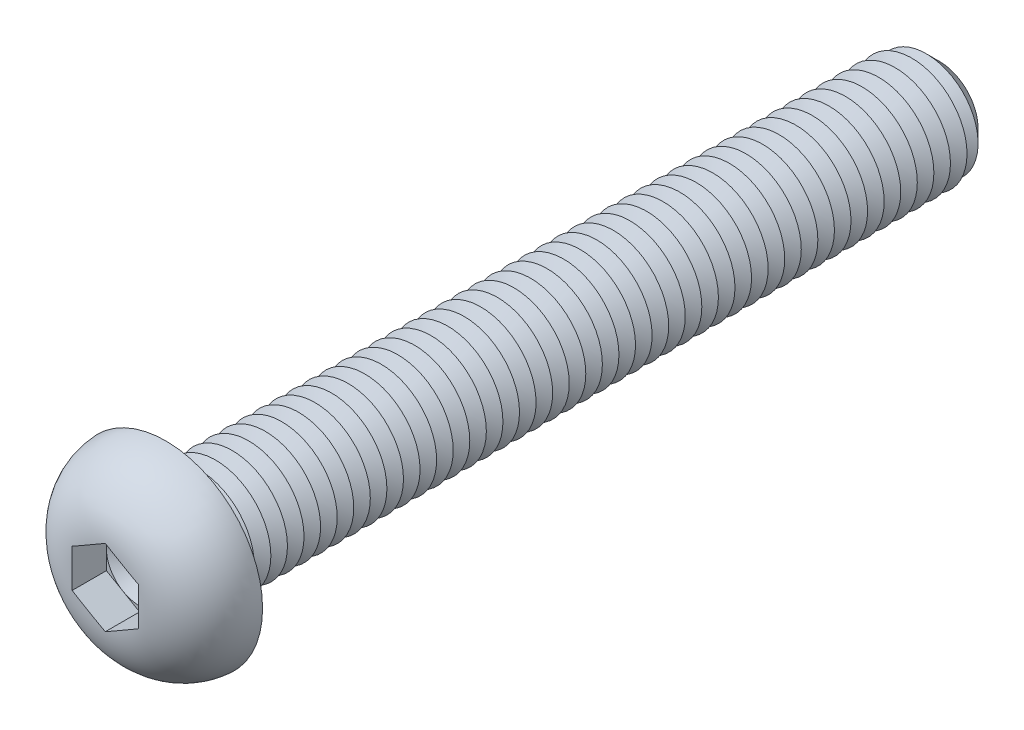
ISO-10303-21;
HEADER;
FILE_DESCRIPTION(('STEP AP214'),'2;1');
FILE_NAME('part.step','',(''),(''),'','','');
FILE_SCHEMA(('AUTOMOTIVE_DESIGN { 1 0 10303 214 1 1 1 1 }'));
ENDSEC;
DATA;
#1=APPLICATION_CONTEXT('core data for automotive mechanical design processes');
#2=APPLICATION_PROTOCOL_DEFINITION('international standard','automotive_design',2000,#1);
#3=PRODUCT_CONTEXT('',#1,'mechanical');
#4=PRODUCT('Part','Part','',(#3));
#5=PRODUCT_RELATED_PRODUCT_CATEGORY('part','',(#4));
#6=PRODUCT_DEFINITION_FORMATION('','',#4);
#7=PRODUCT_DEFINITION_CONTEXT('part definition',#1,'design');
#8=PRODUCT_DEFINITION('design','',#6,#7);
#9=PRODUCT_DEFINITION_SHAPE('','',#8);
#10=(LENGTH_UNIT() NAMED_UNIT(*) SI_UNIT(.MILLI.,.METRE.));
#11=(NAMED_UNIT(*) PLANE_ANGLE_UNIT() SI_UNIT($,.RADIAN.));
#12=(NAMED_UNIT(*) SI_UNIT($,.STERADIAN.) SOLID_ANGLE_UNIT());
#13=UNCERTAINTY_MEASURE_WITH_UNIT(LENGTH_MEASURE(1.E-05),#10,'distance_accuracy_value','');
#14=(GEOMETRIC_REPRESENTATION_CONTEXT(3) GLOBAL_UNCERTAINTY_ASSIGNED_CONTEXT((#13)) GLOBAL_UNIT_ASSIGNED_CONTEXT((#10,
#11,#12)) REPRESENTATION_CONTEXT('',''));
#15=CARTESIAN_POINT('',(0.,0.,0.));
#16=DIRECTION('',(0.,0.,1.));
#17=DIRECTION('',(1.,0.,0.));
#18=AXIS2_PLACEMENT_3D('',#15,#16,#17);
#19=CARTESIAN_POINT('',(0.,0.,2.38));
#20=DIRECTION('',(0.,0.,1.));
#21=DIRECTION('',(1.,0.,0.));
#22=AXIS2_PLACEMENT_3D('',#19,#20,#21);
#23=PLANE('',#22);
#24=CARTESIAN_POINT('',(0.,0.,2.38));
#25=DIRECTION('',(0.,0.,1.));
#26=DIRECTION('',(1.,0.,0.));
#27=AXIS2_PLACEMENT_3D('',#24,#25,#26);
#28=CIRCLE('',#27,3.);
#29=CARTESIAN_POINT('',(3.,0.,2.38));
#30=VERTEX_POINT('',#29);
#31=CARTESIAN_POINT('',(1.5,2.59807621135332,2.38));
#32=VERTEX_POINT('',#31);
#33=EDGE_CURVE('E117',#30,#32,#28,.T.);
#34=ORIENTED_EDGE('',*,*,#33,.F.);
#35=DIRECTION('',(0.,1.,0.));
#36=VECTOR('',#35,1.);
#37=CARTESIAN_POINT('',(3.,-1.73205080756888,2.38));
#38=LINE('',#37,#36);
#39=CARTESIAN_POINT('',(3.,1.73205080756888,2.38));
#40=VERTEX_POINT('',#39);
#41=EDGE_CURVE('E140',#30,#40,#38,.T.);
#42=ORIENTED_EDGE('',*,*,#41,.T.);
#43=DIRECTION('',(-0.866025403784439,0.5,0.));
#44=VECTOR('',#43,1.);
#45=CARTESIAN_POINT('',(3.,1.73205080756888,2.38));
#46=LINE('',#45,#44);
#47=EDGE_CURVE('E136',#40,#32,#46,.T.);
#48=ORIENTED_EDGE('',*,*,#47,.T.);
#49=EDGE_LOOP('',(#34,#42,#48));
#50=FACE_BOUND('',#49,.T.);
#51=ADVANCED_FACE('F39',(#50),#23,.T.);
#52=CARTESIAN_POINT('',(0.,0.,2.38));
#53=DIRECTION('',(0.,0.,1.));
#54=DIRECTION('',(1.,0.,0.));
#55=AXIS2_PLACEMENT_3D('',#52,#53,#54);
#56=CIRCLE('',#55,3.);
#57=CARTESIAN_POINT('',(-1.5,2.59807621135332,2.38));
#58=VERTEX_POINT('',#57);
#59=EDGE_CURVE('E11',#32,#58,#56,.T.);
#60=ORIENTED_EDGE('',*,*,#59,.F.);
#61=CARTESIAN_POINT('',(0.,3.46410161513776,2.38));
#62=VERTEX_POINT('',#61);
#63=EDGE_CURVE('E130',#32,#62,#46,.T.);
#64=ORIENTED_EDGE('',*,*,#63,.T.);
#65=DIRECTION('',(-0.866025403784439,-0.5,0.));
#66=VECTOR('',#65,1.);
#67=CARTESIAN_POINT('',(0.,3.46410161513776,2.38));
#68=LINE('',#67,#66);
#69=EDGE_CURVE('E131',#62,#58,#68,.T.);
#70=ORIENTED_EDGE('',*,*,#69,.T.);
#71=EDGE_LOOP('',(#60,#64,#70));
#72=FACE_BOUND('',#71,.T.);
#73=ADVANCED_FACE('F129',(#72),#23,.T.);
#74=CARTESIAN_POINT('',(-3.,0.,2.38));
#75=VERTEX_POINT('',#74);
#76=EDGE_CURVE('E49',#58,#75,#56,.T.);
#77=ORIENTED_EDGE('',*,*,#76,.F.);
#78=CARTESIAN_POINT('',(-3.,1.73205080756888,2.38));
#79=VERTEX_POINT('',#78);
#80=EDGE_CURVE('E143',#58,#79,#68,.T.);
#81=ORIENTED_EDGE('',*,*,#80,.T.);
#82=DIRECTION('',(0.,-1.,0.));
#83=VECTOR('',#82,1.);
#84=CARTESIAN_POINT('',(-3.,1.73205080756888,2.38));
#85=LINE('',#84,#83);
#86=EDGE_CURVE('E153',#79,#75,#85,.T.);
#87=ORIENTED_EDGE('',*,*,#86,.T.);
#88=EDGE_LOOP('',(#77,#81,#87));
#89=FACE_BOUND('',#88,.T.);
#90=ADVANCED_FACE('F275',(#89),#23,.T.);
#91=CARTESIAN_POINT('',(-1.5,-2.59807621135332,2.38));
#92=VERTEX_POINT('',#91);
#93=EDGE_CURVE('E258',#75,#92,#56,.T.);
#94=ORIENTED_EDGE('',*,*,#93,.F.);
#95=CARTESIAN_POINT('',(-3.,-1.73205080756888,2.38));
#96=VERTEX_POINT('',#95);
#97=EDGE_CURVE('E152',#75,#96,#85,.T.);
#98=ORIENTED_EDGE('',*,*,#97,.T.);
#99=DIRECTION('',(0.866025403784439,-0.5,0.));
#100=VECTOR('',#99,1.);
#101=CARTESIAN_POINT('',(-3.,-1.73205080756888,2.38));
#102=LINE('',#101,#100);
#103=EDGE_CURVE('E158',#96,#92,#102,.T.);
#104=ORIENTED_EDGE('',*,*,#103,.T.);
#105=EDGE_LOOP('',(#94,#98,#104));
#106=FACE_BOUND('',#105,.T.);
#107=ADVANCED_FACE('F269',(#106),#23,.T.);
#108=CARTESIAN_POINT('',(1.5,-2.59807621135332,2.38));
#109=VERTEX_POINT('',#108);
#110=EDGE_CURVE('E56',#92,#109,#56,.T.);
#111=ORIENTED_EDGE('',*,*,#110,.F.);
#112=CARTESIAN_POINT('',(0.,-3.46410161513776,2.38));
#113=VERTEX_POINT('',#112);
#114=EDGE_CURVE('E157',#92,#113,#102,.T.);
#115=ORIENTED_EDGE('',*,*,#114,.T.);
#116=DIRECTION('',(0.866025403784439,0.5,0.));
#117=VECTOR('',#116,1.);
#118=CARTESIAN_POINT('',(0.,-3.46410161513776,2.38));
#119=LINE('',#118,#117);
#120=EDGE_CURVE('E163',#113,#109,#119,.T.);
#121=ORIENTED_EDGE('',*,*,#120,.T.);
#122=EDGE_LOOP('',(#111,#115,#121));
#123=FACE_BOUND('',#122,.T.);
#124=ADVANCED_FACE('F312',(#123),#23,.T.);
#125=CARTESIAN_POINT('',(0.,0.,-70.));
#126=DIRECTION('',(0.,0.,1.));
#127=DIRECTION('',(1.,0.,0.));
#128=AXIS2_PLACEMENT_3D('',#125,#126,#127);
#129=CYLINDRICAL_SURFACE('',#128,5.);
#130=CARTESIAN_POINT('',(0.,0.,-0.600000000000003));
#131=DIRECTION('',(0.,0.,1.));
#132=DIRECTION('',(1.,0.,0.));
#133=AXIS2_PLACEMENT_3D('',#130,#131,#132);
#134=CIRCLE('',#133,5.);
#135=CARTESIAN_POINT('',(5.,0.,-0.600000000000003));
#136=VERTEX_POINT('',#135);
#137=EDGE_CURVE('E241',#136,#136,#134,.F.);
#138=ORIENTED_EDGE('',*,*,#137,.T.);
#139=EDGE_LOOP('',(#138));
#140=FACE_BOUND('',#139,.T.);
#141=CARTESIAN_POINT('',(0.,0.,-1.5));
#142=DIRECTION('',(0.,0.,1.));
#143=DIRECTION('',(1.,0.,0.));
#144=AXIS2_PLACEMENT_3D('',#141,#142,#143);
#145=CIRCLE('',#144,5.00000000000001);
#146=CARTESIAN_POINT('',(5.00000000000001,0.,-1.5));
#147=VERTEX_POINT('',#146);
#148=EDGE_CURVE('E138',#147,#147,#145,.T.);
#149=ORIENTED_EDGE('',*,*,#148,.T.);
#150=EDGE_LOOP('',(#149));
#151=FACE_BOUND('',#150,.T.);
#152=ADVANCED_FACE('F313',(#140,#151),#129,.T.);
#153=CARTESIAN_POINT('',(0.,8.75,0.));
#154=DIRECTION('',(0.,0.,1.));
#155=DIRECTION('',(1.,0.,0.));
#156=AXIS2_PLACEMENT_3D('',#153,#154,#155);
#157=PLANE('',#156);
#158=CARTESIAN_POINT('',(0.,0.,0.));
#159=DIRECTION('',(0.,0.,1.));
#160=DIRECTION('',(1.,0.,0.));
#161=AXIS2_PLACEMENT_3D('',#158,#159,#160);
#162=CIRCLE('',#161,5.6);
#163=CARTESIAN_POINT('',(5.6,0.,0.));
#164=VERTEX_POINT('',#163);
#165=EDGE_CURVE('E249',#164,#164,#162,.T.);
#166=ORIENTED_EDGE('',*,*,#165,.T.);
#167=EDGE_LOOP('',(#166));
#168=FACE_BOUND('',#167,.T.);
#169=CARTESIAN_POINT('',(0.,0.,0.));
#170=DIRECTION('',(0.,0.,1.));
#171=DIRECTION('',(1.,0.,0.));
#172=AXIS2_PLACEMENT_3D('',#169,#170,#171);
#173=CIRCLE('',#172,8.75);
#174=CARTESIAN_POINT('',(8.75,0.,0.));
#175=VERTEX_POINT('',#174);
#176=EDGE_CURVE('E174',#175,#175,#173,.T.);
#177=ORIENTED_EDGE('',*,*,#176,.F.);
#178=EDGE_LOOP('',(#177));
#179=FACE_BOUND('',#178,.T.);
#180=ADVANCED_FACE('F316',(#168,#179),#157,.F.);
#181=CARTESIAN_POINT('',(0.,0.,-0.3));
#182=DIRECTION('',(0.,0.,1.));
#183=DIRECTION('',(1.,0.,0.));
#184=AXIS2_PLACEMENT_3D('',#181,#182,#183);
#185=DEGENERATE_TOROIDAL_SURFACE('',#184,2.95776381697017,5.8,.T.);
#186=CARTESIAN_POINT('',(-3.0002,1.73193533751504,5.47784605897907));
#187=CARTESIAN_POINT('',(-2.87524340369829,1.80407906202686,5.4841525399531));
#188=CARTESIAN_POINT('',(-2.75023731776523,1.87625135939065,5.48853670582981));
#189=CARTESIAN_POINT('',(-2.5001955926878,2.02061301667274,5.49472046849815));
#190=CARTESIAN_POINT('',(-2.37515996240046,2.09280237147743,5.49652051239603));
#191=CARTESIAN_POINT('',(-2.12510741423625,2.23717027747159,5.4987972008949));
#192=CARTESIAN_POINT('',(-2.00009049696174,2.30934882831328,5.49927407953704));
#193=CARTESIAN_POINT('',(-1.75004905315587,2.45371032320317,5.49979859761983));
#194=CARTESIAN_POINT('',(-1.62502452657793,2.52589326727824,5.49984621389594));
#195=CARTESIAN_POINT('',(-1.37497547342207,2.67025915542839,5.49984621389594));
#196=CARTESIAN_POINT('',(-1.24995094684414,2.74244209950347,5.49979859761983));
#197=CARTESIAN_POINT('',(-0.999909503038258,2.88680359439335,5.49927407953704));
#198=CARTESIAN_POINT('',(-0.874892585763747,2.95898214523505,5.4987972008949));
#199=CARTESIAN_POINT('',(-0.624840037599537,3.10335005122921,5.49652051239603));
#200=CARTESIAN_POINT('',(-0.499804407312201,3.1755394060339,5.49472046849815));
#201=CARTESIAN_POINT('',(-0.249762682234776,3.31990106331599,5.48853670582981));
#202=CARTESIAN_POINT('',(-0.124756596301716,3.39207336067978,5.4841525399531));
#203=CARTESIAN_POINT('',(0.000199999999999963,3.46421708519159,5.47784605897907));
#204=B_SPLINE_CURVE_WITH_KNOTS('',3,(#186,#187,#188,#189,#190,#191,#192,#193,#194,#195,#196,
#197,#198,#199,#200,#201,#202,#203),.UNSPECIFIED.,.F.,.F.,(4,2,2,2,2,2,2,2,4),(0.,
0.433225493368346,0.866376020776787,1.29944992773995,1.73254720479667,2.16564448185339,
2.59871838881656,3.031868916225,3.46509440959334),.UNSPECIFIED.);
#205=CARTESIAN_POINT('',(-3.,1.73205080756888,5.4778561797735));
#206=VERTEX_POINT('',#205);
#207=CARTESIAN_POINT('',(0.,3.46410161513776,5.4778561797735));
#208=VERTEX_POINT('',#207);
#209=EDGE_CURVE('E196',#206,#208,#204,.T.);
#210=ORIENTED_EDGE('',*,*,#209,.T.);
#211=CARTESIAN_POINT('',(-0.000200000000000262,3.46421708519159,5.47784605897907));
#212=CARTESIAN_POINT('',(0.124756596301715,3.39207336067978,5.4841525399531));
#213=CARTESIAN_POINT('',(0.249762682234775,3.31990106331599,5.48853670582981));
#214=CARTESIAN_POINT('',(0.4998044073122,3.1755394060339,5.49472046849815));
#215=CARTESIAN_POINT('',(0.624840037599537,3.10335005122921,5.49652051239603));
#216=CARTESIAN_POINT('',(0.874892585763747,2.95898214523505,5.4987972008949));
#217=CARTESIAN_POINT('',(0.999909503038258,2.88680359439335,5.49927407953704));
#218=CARTESIAN_POINT('',(1.24995094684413,2.74244209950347,5.49979859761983));
#219=CARTESIAN_POINT('',(1.37497547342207,2.67025915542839,5.49984621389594));
#220=CARTESIAN_POINT('',(1.62502452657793,2.52589326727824,5.49984621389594));
#221=CARTESIAN_POINT('',(1.75004905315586,2.45371032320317,5.49979859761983));
#222=CARTESIAN_POINT('',(2.00009049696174,2.30934882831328,5.49927407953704));
#223=CARTESIAN_POINT('',(2.12510741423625,2.23717027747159,5.4987972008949));
#224=CARTESIAN_POINT('',(2.37515996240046,2.09280237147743,5.49652051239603));
#225=CARTESIAN_POINT('',(2.5001955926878,2.02061301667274,5.49472046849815));
#226=CARTESIAN_POINT('',(2.75023731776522,1.87625135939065,5.48853670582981));
#227=CARTESIAN_POINT('',(2.87524340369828,1.80407906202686,5.4841525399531));
#228=CARTESIAN_POINT('',(3.0002,1.73193533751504,5.47784605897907));
#229=B_SPLINE_CURVE_WITH_KNOTS('',3,(#211,#212,#213,#214,#215,#216,#217,#218,#219,#220,#221,
#222,#223,#224,#225,#226,#227,#228),.UNSPECIFIED.,.F.,.F.,(4,2,2,2,2,2,2,2,4),(0.,
0.433225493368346,0.866376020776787,1.29944992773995,1.73254720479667,2.16564448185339,
2.59871838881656,3.031868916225,3.46509440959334),.UNSPECIFIED.);
#230=CARTESIAN_POINT('',(3.,1.73205080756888,5.47785617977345));
#231=VERTEX_POINT('',#230);
#232=EDGE_CURVE('E225',#208,#231,#229,.T.);
#233=ORIENTED_EDGE('',*,*,#232,.T.);
#234=CARTESIAN_POINT('',(3.,0.,5.49984621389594));
#235=CARTESIAN_POINT('',(3.,-0.125570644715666,5.49984449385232));
#236=CARTESIAN_POINT('',(3.,-0.251141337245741,5.49980426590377));
#237=CARTESIAN_POINT('',(3.,-0.502283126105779,5.499449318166));
#238=CARTESIAN_POINT('',(3.,-0.62785422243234,5.49913459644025));
#239=CARTESIAN_POINT('',(3.,-0.879037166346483,5.49770394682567));
#240=CARTESIAN_POINT('',(3.,-1.00464901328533,5.49658774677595));
#241=CARTESIAN_POINT('',(3.,-1.2558477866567,5.49279605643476));
#242=CARTESIAN_POINT('',(3.,-1.38143471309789,5.49012056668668));
#243=CARTESIAN_POINT('',(3.,-1.7568847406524,5.47847778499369));
#244=CARTESIAN_POINT('',(3.,-2.00667103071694,5.46590367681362));
#245=CARTESIAN_POINT('',(3.,-2.50488375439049,5.42441448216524));
#246=CARTESIAN_POINT('',(3.,-2.75331093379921,5.3955095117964));
#247=CARTESIAN_POINT('',(3.,-3.18719021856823,5.32582626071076));
#248=CARTESIAN_POINT('',(3.,-3.3733635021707,5.28960049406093));
#249=CARTESIAN_POINT('',(3.,-3.74245496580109,5.20330651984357));
#250=CARTESIAN_POINT('',(3.,-3.92537417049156,5.15324275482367));
#251=CARTESIAN_POINT('',(3.,-4.28675502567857,5.03819885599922));
#252=CARTESIAN_POINT('',(3.,-4.46521058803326,4.97319946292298));
#253=CARTESIAN_POINT('',(3.,-4.81576789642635,4.82782766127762));
#254=CARTESIAN_POINT('',(3.,-4.98786985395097,4.74745576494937));
#255=CARTESIAN_POINT('',(3.,-5.3254008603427,4.5705398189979));
#256=CARTESIAN_POINT('',(3.,-5.49076268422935,4.47386710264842));
#257=CARTESIAN_POINT('',(3.,-5.81151175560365,4.26514040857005));
#258=CARTESIAN_POINT('',(3.,-5.96689840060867,4.15308550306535));
#259=CARTESIAN_POINT('',(3.,-6.26591787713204,3.91428862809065));
#260=CARTESIAN_POINT('',(3.,-6.40955257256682,3.78754899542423));
#261=CARTESIAN_POINT('',(3.,-6.68342295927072,3.52034797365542));
#262=CARTESIAN_POINT('',(3.,-6.81366070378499,3.3798886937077));
#263=CARTESIAN_POINT('',(3.,-7.0426666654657,3.10626157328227));
#264=CARTESIAN_POINT('',(3.,-7.1433109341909,2.97465879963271));
#265=CARTESIAN_POINT('',(3.,-7.33253056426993,2.70304716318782));
#266=CARTESIAN_POINT('',(3.,-7.42110686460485,2.56303895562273));
#267=CARTESIAN_POINT('',(3.,-7.58534868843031,2.27573732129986));
#268=CARTESIAN_POINT('',(3.,-7.66102067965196,2.12844759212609));
#269=CARTESIAN_POINT('',(3.,-7.79881901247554,1.82765987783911));
#270=CARTESIAN_POINT('',(3.,-7.86094563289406,1.67416202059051));
#271=CARTESIAN_POINT('',(3.,-7.96803488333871,1.37082076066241));
#272=CARTESIAN_POINT('',(3.,-8.01375687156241,1.22124490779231));
#273=CARTESIAN_POINT('',(3.,-8.09224398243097,0.918674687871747));
#274=CARTESIAN_POINT('',(3.,-8.12500479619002,0.765679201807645));
#275=CARTESIAN_POINT('',(3.,-8.17726457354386,0.457507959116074));
#276=CARTESIAN_POINT('',(3.,-8.1967692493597,0.302333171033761));
#277=CARTESIAN_POINT('',(3.,-8.22238322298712,-0.00917738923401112));
#278=CARTESIAN_POINT('',(3.,-8.22848754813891,-0.165513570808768));
#279=CARTESIAN_POINT('',(3.,-8.22724693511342,-0.475358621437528));
#280=CARTESIAN_POINT('',(3.,-8.2201384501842,-0.628868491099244));
#281=CARTESIAN_POINT('',(3.,-8.1929851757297,-0.934809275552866));
#282=CARTESIAN_POINT('',(3.,-8.17293462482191,-1.0872396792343));
#283=CARTESIAN_POINT('',(3.,-8.1200547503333,-1.38984943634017));
#284=CARTESIAN_POINT('',(3.,-8.08722683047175,-1.54002903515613));
#285=CARTESIAN_POINT('',(3.,-8.0090712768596,-1.83702738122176));
#286=CARTESIAN_POINT('',(3.,-7.96374919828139,-1.98384759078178));
#287=CARTESIAN_POINT('',(3.,-7.86096457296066,-2.27315566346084));
#288=CARTESIAN_POINT('',(3.,-7.80350334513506,-2.41564399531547));
#289=CARTESIAN_POINT('',(3.,-7.67691451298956,-2.6952770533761));
#290=CARTESIAN_POINT('',(3.,-7.60779108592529,-2.83242367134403));
#291=CARTESIAN_POINT('',(3.,-7.45837210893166,-3.10056990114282));
#292=CARTESIAN_POINT('',(3.,-7.37807144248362,-3.23156666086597));
#293=CARTESIAN_POINT('',(3.,-7.20697634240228,-3.48645411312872));
#294=CARTESIAN_POINT('',(3.,-7.11618520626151,-3.61034702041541));
#295=CARTESIAN_POINT('',(3.,-6.92334779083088,-3.85210954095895));
#296=CARTESIAN_POINT('',(3.,-6.82115263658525,-3.96986038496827));
#297=CARTESIAN_POINT('',(3.,-6.60745266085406,-4.19658717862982));
#298=CARTESIAN_POINT('',(3.,-6.49594754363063,-4.30556284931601));
#299=CARTESIAN_POINT('',(3.,-6.26450055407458,-4.51413072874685));
#300=CARTESIAN_POINT('',(3.,-6.14455919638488,-4.61372350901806));
#301=CARTESIAN_POINT('',(3.,-5.8971402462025,-4.80306090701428));
#302=CARTESIAN_POINT('',(3.,-5.76966228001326,-4.89280503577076));
#303=CARTESIAN_POINT('',(3.,-5.50268934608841,-5.06561354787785));
#304=CARTESIAN_POINT('',(3.,-5.36291526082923,-5.14824654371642));
#305=CARTESIAN_POINT('',(3.,-5.07726499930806,-5.30226841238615));
#306=CARTESIAN_POINT('',(3.,-4.93138704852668,-5.37365398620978));
#307=CARTESIAN_POINT('',(3.,-4.63484455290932,-5.50505544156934));
#308=CARTESIAN_POINT('',(3.,-4.48418671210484,-5.56508649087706));
#309=CARTESIAN_POINT('',(3.,-4.17906596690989,-5.6740700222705));
#310=CARTESIAN_POINT('',(3.,-4.02460600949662,-5.72303080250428));
#311=CARTESIAN_POINT('',(3.,-3.6739247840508,-5.82125760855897));
#312=CARTESIAN_POINT('',(3.,-3.47687521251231,-5.86756841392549));
#313=CARTESIAN_POINT('',(3.,-3.07981530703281,-5.94521593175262));
#314=CARTESIAN_POINT('',(3.,-2.87980357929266,-5.97654534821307));
#315=CARTESIAN_POINT('',(3.,-2.47751859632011,-6.02656554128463));
#316=CARTESIAN_POINT('',(3.,-2.27523974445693,-6.0452096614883));
#317=CARTESIAN_POINT('',(3.,-1.8700786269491,-6.07274849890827));
#318=CARTESIAN_POINT('',(3.,-1.66719636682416,-6.08164330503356));
#319=CARTESIAN_POINT('',(3.,-1.25887867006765,-6.09343726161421));
#320=CARTESIAN_POINT('',(3.,-1.05344157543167,-6.09626381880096));
#321=CARTESIAN_POINT('',(3.,-0.745285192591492,-6.0985660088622));
#322=CARTESIAN_POINT('',(3.,-0.642567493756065,-6.09901047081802));
#323=CARTESIAN_POINT('',(3.,-0.437131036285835,-6.09957976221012));
#324=CARTESIAN_POINT('',(3.,-0.334412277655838,-6.09970459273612));
#325=CARTESIAN_POINT('',(3.,-0.129132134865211,-6.09984385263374));
#326=CARTESIAN_POINT('',(3.,-0.0265707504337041,-6.09985845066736));
#327=CARTESIAN_POINT('',(3.,0.178552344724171,-6.09981980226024));
#328=CARTESIAN_POINT('',(3.,0.281114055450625,-6.09976655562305));
#329=CARTESIAN_POINT('',(3.,0.486235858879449,-6.09946703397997));
#330=CARTESIAN_POINT('',(3.,0.588795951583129,-6.0992207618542));
#331=CARTESIAN_POINT('',(3.,0.793913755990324,-6.09826017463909));
#332=CARTESIAN_POINT('',(3.,0.896471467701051,-6.097545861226));
#333=CARTESIAN_POINT('',(3.,1.11088851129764,-6.0951586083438));
#334=CARTESIAN_POINT('',(3.,1.22274716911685,-6.0934045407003));
#335=CARTESIAN_POINT('',(3.,1.44642575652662,-6.08829151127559));
#336=CARTESIAN_POINT('',(3.,1.55824568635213,-6.08493255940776));
#337=CARTESIAN_POINT('',(3.,1.89360474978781,-6.07150074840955));
#338=CARTESIAN_POINT('',(3.,2.11703989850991,-6.05807293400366));
#339=CARTESIAN_POINT('',(3.,2.56083256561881,-6.01778675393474));
#340=CARTESIAN_POINT('',(3.,2.78120000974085,-5.99104517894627));
#341=CARTESIAN_POINT('',(3.,3.2192866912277,-5.92065658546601));
#342=CARTESIAN_POINT('',(3.,3.43700630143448,-5.8770119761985));
#343=CARTESIAN_POINT('',(3.,3.82666678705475,-5.78060449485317));
#344=CARTESIAN_POINT('',(3.,3.99942726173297,-5.73116262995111));
#345=CARTESIAN_POINT('',(3.,4.3405567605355,-5.61888897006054));
#346=CARTESIAN_POINT('',(3.,4.50892617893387,-5.55605838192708));
#347=CARTESIAN_POINT('',(3.,4.84049143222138,-5.41635874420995));
#348=CARTESIAN_POINT('',(3.,5.00366586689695,-5.33943871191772));
#349=CARTESIAN_POINT('',(3.,5.32271829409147,-5.17167128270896));
#350=CARTESIAN_POINT('',(3.,5.47859600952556,-5.0808233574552));
#351=CARTESIAN_POINT('',(3.,5.7822829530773,-4.88500135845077));
#352=CARTESIAN_POINT('',(3.,5.93005015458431,-4.77996197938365));
#353=CARTESIAN_POINT('',(3.,6.21523046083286,-4.55663689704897));
#354=CARTESIAN_POINT('',(3.,6.35264336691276,-4.43835093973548));
#355=CARTESIAN_POINT('',(3.,6.61552762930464,-4.18948618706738));
#356=CARTESIAN_POINT('',(3.,6.74101380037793,-4.05892305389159));
#357=CARTESIAN_POINT('',(3.,6.97891308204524,-3.78639059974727));
#358=CARTESIAN_POINT('',(3.,7.09132750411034,-3.64442242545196));
#359=CARTESIAN_POINT('',(3.,7.29113623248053,-3.36530209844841));
#360=CARTESIAN_POINT('',(3.,7.37991316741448,-3.22913733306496));
#361=CARTESIAN_POINT('',(3.,7.5451968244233,-2.94955428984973));
#362=CARTESIAN_POINT('',(3.,7.62170419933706,-2.80613639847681));
#363=CARTESIAN_POINT('',(3.,7.76177641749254,-2.5131168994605));
#364=CARTESIAN_POINT('',(3.,7.82534152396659,-2.36351541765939));
#365=CARTESIAN_POINT('',(3.,7.93897019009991,-2.05926799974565));
#366=CARTESIAN_POINT('',(3.,7.98903395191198,-1.9046221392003));
#367=CARTESIAN_POINT('',(3.,8.07336540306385,-1.59821781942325));
#368=CARTESIAN_POINT('',(3.,8.10821878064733,-1.44662026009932));
#369=CARTESIAN_POINT('',(3.,8.16487862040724,-1.14095089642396));
#370=CARTESIAN_POINT('',(3.,8.18668070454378,-0.986878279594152));
#371=CARTESIAN_POINT('',(3.,8.21703234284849,-0.677515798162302));
#372=CARTESIAN_POINT('',(3.,8.22558889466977,-0.522226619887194));
#373=CARTESIAN_POINT('',(3.,8.22940229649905,-0.211427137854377));
#374=CARTESIAN_POINT('',(3.,8.22465425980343,-0.0559167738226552));
#375=CARTESIAN_POINT('',(3.,8.20204101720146,0.252033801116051));
#376=CARTESIAN_POINT('',(3.,8.18435378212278,0.404487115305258));
#377=CARTESIAN_POINT('',(3.,8.136196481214,0.707418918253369));
#378=CARTESIAN_POINT('',(3.,8.1057217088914,0.857896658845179));
#379=CARTESIAN_POINT('',(3.,8.03224632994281,1.15569567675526));
#380=CARTESIAN_POINT('',(3.,7.9892508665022,1.30301822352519));
#381=CARTESIAN_POINT('',(3.,7.89104818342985,1.59360769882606));
#382=CARTESIAN_POINT('',(3.,7.83583549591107,1.73687277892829));
#383=CARTESIAN_POINT('',(3.,7.71349498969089,2.01864020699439));
#384=CARTESIAN_POINT('',(3.,7.64633814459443,2.1571299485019));
#385=CARTESIAN_POINT('',(3.,7.50076383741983,2.42797950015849));
#386=CARTESIAN_POINT('',(3.,7.42235122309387,2.56034191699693));
#387=CARTESIAN_POINT('',(3.,7.25483284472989,2.8181715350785));
#388=CARTESIAN_POINT('',(3.,7.16572386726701,2.94363664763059));
#389=CARTESIAN_POINT('',(3.,6.9775559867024,3.1867979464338));
#390=CARTESIAN_POINT('',(3.,6.87850037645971,3.30449668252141));
#391=CARTESIAN_POINT('',(3.,6.66919743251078,3.53363644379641));
#392=CARTESIAN_POINT('',(3.,6.55877281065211,3.6449154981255));
#393=CARTESIAN_POINT('',(3.,6.32925753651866,3.85806320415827));
#394=CARTESIAN_POINT('',(3.,6.21016952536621,3.95993470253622));
#395=CARTESIAN_POINT('',(3.,5.96413069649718,4.15386505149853));
#396=CARTESIAN_POINT('',(3.,5.83717459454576,4.24591719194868));
#397=CARTESIAN_POINT('',(3.,5.5764653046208,4.41973423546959));
#398=CARTESIAN_POINT('',(3.,5.4427139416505,4.50150188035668));
#399=CARTESIAN_POINT('',(3.,5.16249709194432,4.65840017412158));
#400=CARTESIAN_POINT('',(3.,5.01573037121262,4.73299250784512));
#401=CARTESIAN_POINT('',(3.,4.71685583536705,4.87057528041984));
#402=CARTESIAN_POINT('',(3.,4.56474751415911,4.93356461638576));
#403=CARTESIAN_POINT('',(3.,4.25657035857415,5.04801407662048));
#404=CARTESIAN_POINT('',(3.,4.10050882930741,5.09949395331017));
#405=CARTESIAN_POINT('',(3.,3.78523286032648,5.19149003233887));
#406=CARTESIAN_POINT('',(3.,3.62601895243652,5.23200806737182));
#407=CARTESIAN_POINT('',(3.,3.32461902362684,5.29856444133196));
#408=CARTESIAN_POINT('',(3.,3.18268434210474,5.32575733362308));
#409=CARTESIAN_POINT('',(3.,2.89760844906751,5.3729307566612));
#410=CARTESIAN_POINT('',(3.,2.75446703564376,5.39291005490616));
#411=CARTESIAN_POINT('',(3.,2.46730946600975,5.42656527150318));
#412=CARTESIAN_POINT('',(3.,2.32329255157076,5.44023457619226));
#413=CARTESIAN_POINT('',(3.,2.03487642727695,5.46234228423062));
#414=CARTESIAN_POINT('',(3.,1.89047722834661,5.4707808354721));
#415=CARTESIAN_POINT('',(3.,1.60058090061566,5.48373897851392));
#416=CARTESIAN_POINT('',(3.,1.45508270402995,5.48823290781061));
#417=CARTESIAN_POINT('',(3.,1.16402671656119,5.49458098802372));
#418=CARTESIAN_POINT('',(3.,1.01846892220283,5.49643495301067));
#419=CARTESIAN_POINT('',(3.,0.72742451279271,5.49877506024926));
#420=CARTESIAN_POINT('',(3.,0.581937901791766,5.49926194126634));
#421=CARTESIAN_POINT('',(3.,0.290967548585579,5.49979850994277));
#422=CARTESIAN_POINT('',(3.,0.145483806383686,5.49984820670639));
#423=CARTESIAN_POINT('',(3.,0.,5.49984621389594));
#424=B_SPLINE_CURVE_WITH_KNOTS('',3,(#234,#235,#236,#237,#238,#239,#240,#241,#242,#243,#244,
#245,#246,#247,#248,#249,#250,#251,#252,#253,#254,#255,#256,#257,#258,#259,#260,#261,#262,#263,
#264,#265,#266,#267,#268,#269,#270,#271,#272,#273,#274,#275,#276,#277,#278,#279,#280,#281,#282,
#283,#284,#285,#286,#287,#288,#289,#290,#291,#292,#293,#294,#295,#296,#297,#298,#299,#300,#301,
#302,#303,#304,#305,#306,#307,#308,#309,#310,#311,#312,#313,#314,#315,#316,#317,#318,#319,#320,
#321,#322,#323,#324,#325,#326,#327,#328,#329,#330,#331,#332,#333,#334,#335,#336,#337,#338,#339,
#340,#341,#342,#343,#344,#345,#346,#347,#348,#349,#350,#351,#352,#353,#354,#355,#356,#357,#358,
#359,#360,#361,#362,#363,#364,#365,#366,#367,#368,#369,#370,#371,#372,#373,#374,#375,#376,#377,
#378,#379,#380,#381,#382,#383,#384,#385,#386,#387,#388,#389,#390,#391,#392,#393,#394,#395,#396,
#397,#398,#399,#400,#401,#402,#403,#404,#405,#406,#407,#408,#409,#410,#411,#412,#413,#414,#415,
#416,#417,#418,#419,#420,#421,#422,#423),.UNSPECIFIED.,.T.,.F.,(4,2,2,2,2,2,2,2,2,2,2,2,2,2,2,2,
2,2,2,2,2,2,2,2,2,2,2,2,2,2,2,2,2,2,2,2,2,2,2,2,2,2,2,2,2,2,2,2,2,2,2,2,2,2,2,2,2,2,2,2,2,2,2,2,
2,2,2,2,2,2,2,2,2,2,2,2,2,2,2,2,2,2,2,2,2,2,2,2,2,2,2,2,2,2,4),(0.,0.376711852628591,
0.753426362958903,1.13026885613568,1.50711121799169,2.257095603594,3.00661592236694,
3.57514719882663,4.14349616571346,4.71258216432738,5.28164920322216,5.85543852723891,
6.42926247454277,7.00299523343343,7.57663992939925,8.07303876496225,8.56939895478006,
9.06550962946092,9.56161009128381,10.030267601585,10.4990807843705,10.9676918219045,
11.4364767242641,11.8969530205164,12.3576344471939,12.8182652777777,13.2786916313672,
13.7390679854,14.1992797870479,14.6597029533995,15.1199817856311,15.5871904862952,
16.0544140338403,16.5216091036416,16.9888273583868,17.4754224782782,17.9621600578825,
18.4482427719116,18.9339599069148,19.5405320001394,20.1473991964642,20.7564865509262,
21.3655683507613,21.9818967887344,22.2900536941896,22.5982095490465,22.905893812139,
23.2135789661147,23.5212595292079,23.8289389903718,24.1645461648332,24.5001512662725,
25.171371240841,25.8368042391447,26.5021424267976,27.0407309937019,27.5792710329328,
28.119799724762,28.660348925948,29.2034761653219,29.7466138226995,30.2890677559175,
30.831467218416,31.3185063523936,31.8055195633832,32.2925228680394,32.779518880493,
33.2456153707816,33.7118681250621,34.1778744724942,34.6440520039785,35.103935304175,
35.563988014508,36.0238520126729,36.4839222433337,36.9451261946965,37.4061321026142,
37.8672768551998,38.3282694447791,38.7980460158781,39.2676799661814,39.7376328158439,
40.207460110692,40.7008436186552,41.1942739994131,41.6868509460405,42.1793454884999,
42.6126940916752,43.0461167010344,43.479992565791,43.9138561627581,44.3505218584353,
44.7872183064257,45.2236787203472,45.6601300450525),.UNSPECIFIED.);
#425=CARTESIAN_POINT('',(3.,-1.73205080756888,5.4778561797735));
#426=VERTEX_POINT('',#425);
#427=EDGE_CURVE('E234',#231,#426,#424,.T.);
#428=ORIENTED_EDGE('',*,*,#427,.T.);
#429=CARTESIAN_POINT('',(3.0002,-1.73193533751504,5.47784605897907));
#430=CARTESIAN_POINT('',(2.87524340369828,-1.80407906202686,5.4841525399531));
#431=CARTESIAN_POINT('',(2.75023731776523,-1.87625135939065,5.48853670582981));
#432=CARTESIAN_POINT('',(2.5001955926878,-2.02061301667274,5.49472046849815));
#433=CARTESIAN_POINT('',(2.37515996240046,-2.09280237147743,5.49652051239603));
#434=CARTESIAN_POINT('',(2.12510741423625,-2.23717027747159,5.4987972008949));
#435=CARTESIAN_POINT('',(2.00009049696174,-2.30934882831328,5.49927407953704));
#436=CARTESIAN_POINT('',(1.75004905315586,-2.45371032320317,5.49979859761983));
#437=CARTESIAN_POINT('',(1.62502452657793,-2.52589326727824,5.49984621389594));
#438=CARTESIAN_POINT('',(1.37497547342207,-2.67025915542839,5.49984621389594));
#439=CARTESIAN_POINT('',(1.24995094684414,-2.74244209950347,5.49979859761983));
#440=CARTESIAN_POINT('',(0.999909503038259,-2.88680359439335,5.49927407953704));
#441=CARTESIAN_POINT('',(0.874892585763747,-2.95898214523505,5.4987972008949));
#442=CARTESIAN_POINT('',(0.624840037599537,-3.10335005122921,5.49652051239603));
#443=CARTESIAN_POINT('',(0.499804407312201,-3.1755394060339,5.49472046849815));
#444=CARTESIAN_POINT('',(0.249762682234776,-3.31990106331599,5.48853670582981));
#445=CARTESIAN_POINT('',(0.124756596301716,-3.39207336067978,5.4841525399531));
#446=CARTESIAN_POINT('',(-0.000199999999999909,-3.46421708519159,5.47784605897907));
#447=B_SPLINE_CURVE_WITH_KNOTS('',3,(#429,#430,#431,#432,#433,#434,#435,#436,#437,#438,#439,
#440,#441,#442,#443,#444,#445,#446),.UNSPECIFIED.,.F.,.F.,(4,2,2,2,2,2,2,2,4),(0.,
0.433225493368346,0.866376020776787,1.29944992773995,1.73254720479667,2.16564448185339,
2.59871838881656,3.031868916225,3.46509440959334),.UNSPECIFIED.);
#448=CARTESIAN_POINT('',(0.,-3.46410161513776,5.4778561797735));
#449=VERTEX_POINT('',#448);
#450=EDGE_CURVE('E286',#426,#449,#447,.T.);
#451=ORIENTED_EDGE('',*,*,#450,.T.);
#452=CARTESIAN_POINT('',(0.000200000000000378,-3.46421708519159,5.47784605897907));
#453=CARTESIAN_POINT('',(-0.124756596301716,-3.39207336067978,5.4841525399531));
#454=CARTESIAN_POINT('',(-0.249762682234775,-3.31990106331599,5.48853670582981));
#455=CARTESIAN_POINT('',(-0.499804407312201,-3.1755394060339,5.49472046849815));
#456=CARTESIAN_POINT('',(-0.624840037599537,-3.10335005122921,5.49652051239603));
#457=CARTESIAN_POINT('',(-0.874892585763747,-2.95898214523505,5.4987972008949));
#458=CARTESIAN_POINT('',(-0.999909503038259,-2.88680359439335,5.49927407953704));
#459=CARTESIAN_POINT('',(-1.24995094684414,-2.74244209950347,5.49979859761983));
#460=CARTESIAN_POINT('',(-1.37497547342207,-2.67025915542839,5.49984621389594));
#461=CARTESIAN_POINT('',(-1.62502452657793,-2.52589326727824,5.49984621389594));
#462=CARTESIAN_POINT('',(-1.75004905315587,-2.45371032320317,5.49979859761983));
#463=CARTESIAN_POINT('',(-2.00009049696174,-2.30934882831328,5.49927407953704));
#464=CARTESIAN_POINT('',(-2.12510741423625,-2.23717027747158,5.4987972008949));
#465=CARTESIAN_POINT('',(-2.37515996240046,-2.09280237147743,5.49652051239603));
#466=CARTESIAN_POINT('',(-2.5001955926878,-2.02061301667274,5.49472046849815));
#467=CARTESIAN_POINT('',(-2.75023731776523,-1.87625135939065,5.48853670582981));
#468=CARTESIAN_POINT('',(-2.87524340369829,-1.80407906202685,5.4841525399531));
#469=CARTESIAN_POINT('',(-3.0002,-1.73193533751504,5.47784605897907));
#470=B_SPLINE_CURVE_WITH_KNOTS('',3,(#452,#453,#454,#455,#456,#457,#458,#459,#460,#461,#462,
#463,#464,#465,#466,#467,#468,#469),.UNSPECIFIED.,.F.,.F.,(4,2,2,2,2,2,2,2,4),(0.,
0.433225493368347,0.866376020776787,1.29944992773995,1.73254720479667,2.16564448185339,
2.59871838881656,3.031868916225,3.46509440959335),.UNSPECIFIED.);
#471=CARTESIAN_POINT('',(-3.,-1.73205080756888,5.47785617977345));
#472=VERTEX_POINT('',#471);
#473=EDGE_CURVE('E282',#449,#472,#470,.T.);
#474=ORIENTED_EDGE('',*,*,#473,.T.);
#475=CARTESIAN_POINT('',(-3.,0.,5.49984621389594));
#476=CARTESIAN_POINT('',(-3.,0.125570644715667,5.49984449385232));
#477=CARTESIAN_POINT('',(-3.,0.251141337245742,5.49980426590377));
#478=CARTESIAN_POINT('',(-3.,0.50228312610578,5.499449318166));
#479=CARTESIAN_POINT('',(-3.,0.627854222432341,5.49913459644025));
#480=CARTESIAN_POINT('',(-3.,0.879037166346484,5.49770394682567));
#481=CARTESIAN_POINT('',(-3.,1.00464901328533,5.49658774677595));
#482=CARTESIAN_POINT('',(-3.,1.2558477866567,5.49279605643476));
#483=CARTESIAN_POINT('',(-3.,1.3814347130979,5.49012056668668));
#484=CARTESIAN_POINT('',(-3.,1.7568847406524,5.47847778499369));
#485=CARTESIAN_POINT('',(-3.,2.00667103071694,5.46590367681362));
#486=CARTESIAN_POINT('',(-3.,2.50488375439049,5.42441448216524));
#487=CARTESIAN_POINT('',(-3.,2.75331093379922,5.3955095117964));
#488=CARTESIAN_POINT('',(-3.,3.18719021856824,5.32582626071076));
#489=CARTESIAN_POINT('',(-3.,3.3733635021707,5.28960049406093));
#490=CARTESIAN_POINT('',(-3.,3.74245496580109,5.20330651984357));
#491=CARTESIAN_POINT('',(-3.,3.92537417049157,5.15324275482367));
#492=CARTESIAN_POINT('',(-3.,4.28675502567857,5.03819885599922));
#493=CARTESIAN_POINT('',(-3.,4.46521058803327,4.97319946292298));
#494=CARTESIAN_POINT('',(-3.,4.81576789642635,4.82782766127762));
#495=CARTESIAN_POINT('',(-3.,4.98786985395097,4.74745576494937));
#496=CARTESIAN_POINT('',(-3.,5.3254008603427,4.5705398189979));
#497=CARTESIAN_POINT('',(-3.,5.49076268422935,4.47386710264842));
#498=CARTESIAN_POINT('',(-3.,5.81151175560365,4.26514040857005));
#499=CARTESIAN_POINT('',(-3.,5.96689840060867,4.15308550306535));
#500=CARTESIAN_POINT('',(-3.,6.26591787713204,3.91428862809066));
#501=CARTESIAN_POINT('',(-3.,6.40955257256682,3.78754899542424));
#502=CARTESIAN_POINT('',(-3.,6.68342295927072,3.52034797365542));
#503=CARTESIAN_POINT('',(-3.,6.81366070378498,3.3798886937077));
#504=CARTESIAN_POINT('',(-3.,7.0426666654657,3.10626157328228));
#505=CARTESIAN_POINT('',(-3.,7.14331093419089,2.97465879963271));
#506=CARTESIAN_POINT('',(-3.,7.33253056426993,2.70304716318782));
#507=CARTESIAN_POINT('',(-3.,7.42110686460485,2.56303895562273));
#508=CARTESIAN_POINT('',(-3.,7.58534868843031,2.27573732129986));
#509=CARTESIAN_POINT('',(-3.,7.66102067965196,2.12844759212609));
#510=CARTESIAN_POINT('',(-3.,7.79881901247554,1.82765987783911));
#511=CARTESIAN_POINT('',(-3.,7.86094563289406,1.67416202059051));
#512=CARTESIAN_POINT('',(-3.,7.96803488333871,1.37082076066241));
#513=CARTESIAN_POINT('',(-3.,8.01375687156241,1.22124490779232));
#514=CARTESIAN_POINT('',(-3.,8.09224398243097,0.918674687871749));
#515=CARTESIAN_POINT('',(-3.,8.12500479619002,0.765679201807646));
#516=CARTESIAN_POINT('',(-3.,8.17726457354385,0.457507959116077));
#517=CARTESIAN_POINT('',(-3.,8.1967692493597,0.302333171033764));
#518=CARTESIAN_POINT('',(-3.,8.22238322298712,-0.00917738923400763));
#519=CARTESIAN_POINT('',(-3.,8.22848754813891,-0.165513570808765));
#520=CARTESIAN_POINT('',(-3.,8.22724693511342,-0.475358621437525));
#521=CARTESIAN_POINT('',(-3.,8.2201384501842,-0.628868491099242));
#522=CARTESIAN_POINT('',(-3.,8.1929851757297,-0.934809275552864));
#523=CARTESIAN_POINT('',(-3.,8.17293462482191,-1.08723967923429));
#524=CARTESIAN_POINT('',(-3.,8.1200547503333,-1.38984943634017));
#525=CARTESIAN_POINT('',(-3.,8.08722683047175,-1.54002903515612));
#526=CARTESIAN_POINT('',(-3.,8.0090712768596,-1.83702738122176));
#527=CARTESIAN_POINT('',(-3.,7.96374919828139,-1.98384759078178));
#528=CARTESIAN_POINT('',(-3.,7.86096457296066,-2.27315566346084));
#529=CARTESIAN_POINT('',(-3.,7.80350334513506,-2.41564399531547));
#530=CARTESIAN_POINT('',(-3.,7.67691451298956,-2.69527705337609));
#531=CARTESIAN_POINT('',(-3.,7.60779108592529,-2.83242367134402));
#532=CARTESIAN_POINT('',(-3.,7.45837210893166,-3.10056990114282));
#533=CARTESIAN_POINT('',(-3.,7.37807144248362,-3.23156666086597));
#534=CARTESIAN_POINT('',(-3.,7.20697634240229,-3.48645411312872));
#535=CARTESIAN_POINT('',(-3.,7.11618520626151,-3.61034702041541));
#536=CARTESIAN_POINT('',(-3.,6.92334779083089,-3.85210954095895));
#537=CARTESIAN_POINT('',(-3.,6.82115263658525,-3.96986038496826));
#538=CARTESIAN_POINT('',(-3.,6.60745266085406,-4.19658717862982));
#539=CARTESIAN_POINT('',(-3.,6.49594754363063,-4.30556284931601));
#540=CARTESIAN_POINT('',(-3.,6.26450055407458,-4.51413072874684));
#541=CARTESIAN_POINT('',(-3.,6.14455919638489,-4.61372350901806));
#542=CARTESIAN_POINT('',(-3.,5.8971402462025,-4.80306090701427));
#543=CARTESIAN_POINT('',(-3.,5.76966228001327,-4.89280503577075));
#544=CARTESIAN_POINT('',(-3.,5.50268934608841,-5.06561354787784));
#545=CARTESIAN_POINT('',(-3.,5.36291526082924,-5.14824654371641));
#546=CARTESIAN_POINT('',(-3.,5.07726499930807,-5.30226841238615));
#547=CARTESIAN_POINT('',(-3.,4.93138704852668,-5.37365398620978));
#548=CARTESIAN_POINT('',(-3.,4.63484455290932,-5.50505544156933));
#549=CARTESIAN_POINT('',(-3.,4.48418671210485,-5.56508649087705));
#550=CARTESIAN_POINT('',(-3.,4.17906596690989,-5.6740700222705));
#551=CARTESIAN_POINT('',(-3.,4.02460600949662,-5.72303080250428));
#552=CARTESIAN_POINT('',(-3.,3.6739247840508,-5.82125760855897));
#553=CARTESIAN_POINT('',(-3.,3.47687521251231,-5.86756841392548));
#554=CARTESIAN_POINT('',(-3.,3.07981530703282,-5.94521593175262));
#555=CARTESIAN_POINT('',(-3.,2.87980357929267,-5.97654534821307));
#556=CARTESIAN_POINT('',(-3.,2.47751859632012,-6.02656554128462));
#557=CARTESIAN_POINT('',(-3.,2.27523974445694,-6.0452096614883));
#558=CARTESIAN_POINT('',(-3.,1.87007862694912,-6.07274849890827));
#559=CARTESIAN_POINT('',(-3.,1.66719636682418,-6.08164330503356));
#560=CARTESIAN_POINT('',(-3.,1.25887867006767,-6.09343726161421));
#561=CARTESIAN_POINT('',(-3.,1.05344157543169,-6.09626381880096));
#562=CARTESIAN_POINT('',(-3.,0.745285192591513,-6.0985660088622));
#563=CARTESIAN_POINT('',(-3.,0.642567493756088,-6.09901047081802));
#564=CARTESIAN_POINT('',(-3.,0.437131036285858,-6.09957976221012));
#565=CARTESIAN_POINT('',(-3.,0.334412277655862,-6.09970459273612));
#566=CARTESIAN_POINT('',(-3.,0.129132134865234,-6.09984385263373));
#567=CARTESIAN_POINT('',(-3.,0.0265707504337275,-6.09985845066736));
#568=CARTESIAN_POINT('',(-3.,-0.178552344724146,-6.09981980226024));
#569=CARTESIAN_POINT('',(-3.,-0.281114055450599,-6.09976655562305));
#570=CARTESIAN_POINT('',(-3.,-0.486235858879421,-6.09946703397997));
#571=CARTESIAN_POINT('',(-3.,-0.588795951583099,-6.0992207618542));
#572=CARTESIAN_POINT('',(-3.,-0.793913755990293,-6.09826017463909));
#573=CARTESIAN_POINT('',(-3.,-0.89647146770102,-6.097545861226));
#574=CARTESIAN_POINT('',(-3.,-1.11088851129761,-6.0951586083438));
#575=CARTESIAN_POINT('',(-3.,-1.22274716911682,-6.0934045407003));
#576=CARTESIAN_POINT('',(-3.,-1.44642575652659,-6.08829151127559));
#577=CARTESIAN_POINT('',(-3.,-1.55824568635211,-6.08493255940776));
#578=CARTESIAN_POINT('',(-3.,-1.89360474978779,-6.07150074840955));
#579=CARTESIAN_POINT('',(-3.,-2.11703989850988,-6.05807293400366));
#580=CARTESIAN_POINT('',(-3.,-2.56083256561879,-6.01778675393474));
#581=CARTESIAN_POINT('',(-3.,-2.78120000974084,-5.99104517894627));
#582=CARTESIAN_POINT('',(-3.,-3.21928669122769,-5.92065658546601));
#583=CARTESIAN_POINT('',(-3.,-3.43700630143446,-5.8770119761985));
#584=CARTESIAN_POINT('',(-3.,-3.82666678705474,-5.78060449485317));
#585=CARTESIAN_POINT('',(-3.,-3.99942726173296,-5.73116262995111));
#586=CARTESIAN_POINT('',(-3.,-4.34055676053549,-5.61888897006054));
#587=CARTESIAN_POINT('',(-3.,-4.50892617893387,-5.55605838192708));
#588=CARTESIAN_POINT('',(-3.,-4.84049143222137,-5.41635874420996));
#589=CARTESIAN_POINT('',(-3.,-5.00366586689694,-5.33943871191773));
#590=CARTESIAN_POINT('',(-3.,-5.32271829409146,-5.17167128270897));
#591=CARTESIAN_POINT('',(-3.,-5.47859600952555,-5.08082335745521));
#592=CARTESIAN_POINT('',(-3.,-5.78228295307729,-4.88500135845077));
#593=CARTESIAN_POINT('',(-3.,-5.9300501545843,-4.77996197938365));
#594=CARTESIAN_POINT('',(-3.,-6.21523046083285,-4.55663689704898));
#595=CARTESIAN_POINT('',(-3.,-6.35264336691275,-4.43835093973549));
#596=CARTESIAN_POINT('',(-3.,-6.61552762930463,-4.18948618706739));
#597=CARTESIAN_POINT('',(-3.,-6.74101380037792,-4.05892305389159));
#598=CARTESIAN_POINT('',(-3.,-6.97891308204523,-3.78639059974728));
#599=CARTESIAN_POINT('',(-3.,-7.09132750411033,-3.64442242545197));
#600=CARTESIAN_POINT('',(-3.,-7.29113623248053,-3.36530209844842));
#601=CARTESIAN_POINT('',(-3.,-7.37991316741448,-3.22913733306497));
#602=CARTESIAN_POINT('',(-3.,-7.54519682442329,-2.94955428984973));
#603=CARTESIAN_POINT('',(-3.,-7.62170419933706,-2.80613639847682));
#604=CARTESIAN_POINT('',(-3.,-7.76177641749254,-2.5131168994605));
#605=CARTESIAN_POINT('',(-3.,-7.82534152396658,-2.3635154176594));
#606=CARTESIAN_POINT('',(-3.,-7.93897019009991,-2.05926799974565));
#607=CARTESIAN_POINT('',(-3.,-7.98903395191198,-1.9046221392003));
#608=CARTESIAN_POINT('',(-3.,-8.07336540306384,-1.59821781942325));
#609=CARTESIAN_POINT('',(-3.,-8.10821878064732,-1.44662026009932));
#610=CARTESIAN_POINT('',(-3.,-8.16487862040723,-1.14095089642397));
#611=CARTESIAN_POINT('',(-3.,-8.18668070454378,-0.986878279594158));
#612=CARTESIAN_POINT('',(-3.,-8.21703234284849,-0.677515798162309));
#613=CARTESIAN_POINT('',(-3.,-8.22558889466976,-0.522226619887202));
#614=CARTESIAN_POINT('',(-3.,-8.22940229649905,-0.211427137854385));
#615=CARTESIAN_POINT('',(-3.,-8.22465425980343,-0.0559167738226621));
#616=CARTESIAN_POINT('',(-3.,-8.20204101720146,0.252033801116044));
#617=CARTESIAN_POINT('',(-3.,-8.18435378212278,0.40448711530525));
#618=CARTESIAN_POINT('',(-3.,-8.136196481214,0.707418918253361));
#619=CARTESIAN_POINT('',(-3.,-8.1057217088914,0.857896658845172));
#620=CARTESIAN_POINT('',(-3.,-8.03224632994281,1.15569567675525));
#621=CARTESIAN_POINT('',(-3.,-7.9892508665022,1.30301822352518));
#622=CARTESIAN_POINT('',(-3.,-7.89104818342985,1.59360769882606));
#623=CARTESIAN_POINT('',(-3.,-7.83583549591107,1.73687277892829));
#624=CARTESIAN_POINT('',(-3.,-7.71349498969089,2.01864020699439));
#625=CARTESIAN_POINT('',(-3.,-7.64633814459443,2.1571299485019));
#626=CARTESIAN_POINT('',(-3.,-7.50076383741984,2.42797950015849));
#627=CARTESIAN_POINT('',(-3.,-7.42235122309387,2.56034191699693));
#628=CARTESIAN_POINT('',(-3.,-7.25483284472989,2.81817153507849));
#629=CARTESIAN_POINT('',(-3.,-7.16572386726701,2.94363664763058));
#630=CARTESIAN_POINT('',(-3.,-6.97755598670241,3.1867979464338));
#631=CARTESIAN_POINT('',(-3.,-6.87850037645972,3.30449668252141));
#632=CARTESIAN_POINT('',(-3.,-6.66919743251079,3.53363644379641));
#633=CARTESIAN_POINT('',(-3.,-6.55877281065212,3.64491549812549));
#634=CARTESIAN_POINT('',(-3.,-6.32925753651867,3.85806320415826));
#635=CARTESIAN_POINT('',(-3.,-6.21016952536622,3.95993470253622));
#636=CARTESIAN_POINT('',(-3.,-5.96413069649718,4.15386505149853));
#637=CARTESIAN_POINT('',(-3.,-5.83717459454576,4.24591719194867));
#638=CARTESIAN_POINT('',(-3.,-5.5764653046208,4.41973423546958));
#639=CARTESIAN_POINT('',(-3.,-5.4427139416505,4.50150188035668));
#640=CARTESIAN_POINT('',(-3.,-5.16249709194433,4.65840017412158));
#641=CARTESIAN_POINT('',(-3.,-5.01573037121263,4.73299250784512));
#642=CARTESIAN_POINT('',(-3.,-4.71685583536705,4.87057528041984));
#643=CARTESIAN_POINT('',(-3.,-4.56474751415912,4.93356461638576));
#644=CARTESIAN_POINT('',(-3.,-4.25657035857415,5.04801407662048));
#645=CARTESIAN_POINT('',(-3.,-4.10050882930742,5.09949395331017));
#646=CARTESIAN_POINT('',(-3.,-3.78523286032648,5.19149003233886));
#647=CARTESIAN_POINT('',(-3.,-3.62601895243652,5.23200806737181));
#648=CARTESIAN_POINT('',(-3.,-3.32461902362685,5.29856444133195));
#649=CARTESIAN_POINT('',(-3.,-3.18268434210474,5.32575733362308));
#650=CARTESIAN_POINT('',(-3.,-2.89760844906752,5.3729307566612));
#651=CARTESIAN_POINT('',(-3.,-2.75446703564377,5.39291005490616));
#652=CARTESIAN_POINT('',(-3.,-2.46730946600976,5.42656527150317));
#653=CARTESIAN_POINT('',(-3.,-2.32329255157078,5.44023457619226));
#654=CARTESIAN_POINT('',(-3.,-2.03487642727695,5.46234228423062));
#655=CARTESIAN_POINT('',(-3.,-1.89047722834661,5.4707808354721));
#656=CARTESIAN_POINT('',(-3.,-1.60058090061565,5.48373897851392));
#657=CARTESIAN_POINT('',(-3.,-1.45508270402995,5.48823290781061));
#658=CARTESIAN_POINT('',(-3.,-1.16402671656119,5.49458098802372));
#659=CARTESIAN_POINT('',(-3.,-1.01846892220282,5.49643495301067));
#660=CARTESIAN_POINT('',(-3.,-0.727424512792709,5.49877506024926));
#661=CARTESIAN_POINT('',(-3.,-0.581937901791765,5.49926194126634));
#662=CARTESIAN_POINT('',(-3.,-0.290967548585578,5.49979850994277));
#663=CARTESIAN_POINT('',(-3.,-0.145483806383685,5.49984820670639));
#664=CARTESIAN_POINT('',(-3.,0.,5.49984621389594));
#665=B_SPLINE_CURVE_WITH_KNOTS('',3,(#475,#476,#477,#478,#479,#480,#481,#482,#483,#484,#485,
#486,#487,#488,#489,#490,#491,#492,#493,#494,#495,#496,#497,#498,#499,#500,#501,#502,#503,#504,
#505,#506,#507,#508,#509,#510,#511,#512,#513,#514,#515,#516,#517,#518,#519,#520,#521,#522,#523,
#524,#525,#526,#527,#528,#529,#530,#531,#532,#533,#534,#535,#536,#537,#538,#539,#540,#541,#542,
#543,#544,#545,#546,#547,#548,#549,#550,#551,#552,#553,#554,#555,#556,#557,#558,#559,#560,#561,
#562,#563,#564,#565,#566,#567,#568,#569,#570,#571,#572,#573,#574,#575,#576,#577,#578,#579,#580,
#581,#582,#583,#584,#585,#586,#587,#588,#589,#590,#591,#592,#593,#594,#595,#596,#597,#598,#599,
#600,#601,#602,#603,#604,#605,#606,#607,#608,#609,#610,#611,#612,#613,#614,#615,#616,#617,#618,
#619,#620,#621,#622,#623,#624,#625,#626,#627,#628,#629,#630,#631,#632,#633,#634,#635,#636,#637,
#638,#639,#640,#641,#642,#643,#644,#645,#646,#647,#648,#649,#650,#651,#652,#653,#654,#655,#656,
#657,#658,#659,#660,#661,#662,#663,#664),.UNSPECIFIED.,.T.,.F.,(4,2,2,2,2,2,2,2,2,2,2,2,2,2,2,2,
2,2,2,2,2,2,2,2,2,2,2,2,2,2,2,2,2,2,2,2,2,2,2,2,2,2,2,2,2,2,2,2,2,2,2,2,2,2,2,2,2,2,2,2,2,2,2,2,
2,2,2,2,2,2,2,2,2,2,2,2,2,2,2,2,2,2,2,2,2,2,2,2,2,2,2,2,2,2,4),(0.,0.376711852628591,
0.753426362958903,1.13026885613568,1.50711121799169,2.257095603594,3.00661592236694,
3.57514719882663,4.14349616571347,4.71258216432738,5.28164920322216,5.85543852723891,
6.42926247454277,7.00299523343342,7.57663992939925,8.07303876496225,8.56939895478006,
9.06550962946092,9.56161009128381,10.030267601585,10.4990807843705,10.9676918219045,
11.4364767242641,11.8969530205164,12.3576344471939,12.8182652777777,13.2786916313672,
13.7390679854,14.1992797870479,14.6597029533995,15.1199817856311,15.5871904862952,
16.0544140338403,16.5216091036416,16.9888273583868,17.4754224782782,17.9621600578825,
18.4482427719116,18.9339599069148,19.5405320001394,20.1473991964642,20.7564865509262,
21.3655683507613,21.9818967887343,22.2900536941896,22.5982095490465,22.905893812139,
23.2135789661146,23.5212595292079,23.8289389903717,24.1645461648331,24.5001512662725,
25.171371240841,25.8368042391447,26.5021424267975,27.0407309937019,27.5792710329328,
28.1197997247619,28.6603489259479,29.2034761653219,29.7466138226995,30.2890677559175,
30.831467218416,31.3185063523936,31.8055195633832,32.2925228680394,32.779518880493,
33.2456153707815,33.711868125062,34.1778744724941,34.6440520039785,35.103935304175,
35.563988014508,36.0238520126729,36.4839222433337,36.9451261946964,37.4061321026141,
37.8672768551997,38.3282694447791,38.798046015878,39.2676799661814,39.7376328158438,
40.207460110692,40.7008436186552,41.194273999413,41.6868509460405,42.1793454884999,
42.6126940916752,43.0461167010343,43.479992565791,43.913856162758,44.3505218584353,
44.7872183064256,45.2236787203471,45.6601300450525),.UNSPECIFIED.);
#666=EDGE_CURVE('E205',#472,#206,#665,.T.);
#667=ORIENTED_EDGE('',*,*,#666,.T.);
#668=EDGE_LOOP('',(#210,#233,#428,#451,#474,#667));
#669=FACE_BOUND('',#668,.T.);
#670=ORIENTED_EDGE('',*,*,#176,.T.);
#671=EDGE_LOOP('',(#670));
#672=FACE_BOUND('',#671,.T.);
#673=ADVANCED_FACE('F210',(#669,#672),#185,.T.);
#674=CARTESIAN_POINT('',(3.,1.73205080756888,2.38));
#675=DIRECTION('',(0.5,0.866025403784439,0.));
#676=DIRECTION('',(-0.866025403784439,0.5,0.));
#677=AXIS2_PLACEMENT_3D('',#674,#675,#676);
#678=PLANE('',#677);
#679=DIRECTION('',(0.,0.,1.));
#680=VECTOR('',#679,1.);
#681=CARTESIAN_POINT('',(0.,3.46410161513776,2.38));
#682=LINE('',#681,#680);
#683=EDGE_CURVE('E64',#62,#208,#682,.T.);
#684=ORIENTED_EDGE('',*,*,#683,.F.);
#685=ORIENTED_EDGE('',*,*,#63,.F.);
#686=ORIENTED_EDGE('',*,*,#47,.F.);
#687=DIRECTION('',(0.,0.,1.));
#688=VECTOR('',#687,1.);
#689=CARTESIAN_POINT('',(3.,1.73205080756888,2.38));
#690=LINE('',#689,#688);
#691=EDGE_CURVE('E171',#40,#231,#690,.T.);
#692=ORIENTED_EDGE('',*,*,#691,.T.);
#693=ORIENTED_EDGE('',*,*,#232,.F.);
#694=EDGE_LOOP('',(#684,#685,#686,#692,#693));
#695=FACE_BOUND('',#694,.T.);
#696=ADVANCED_FACE('F134',(#695),#678,.F.);
#697=CARTESIAN_POINT('',(3.,-1.73205080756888,2.38));
#698=DIRECTION('',(1.,0.,0.));
#699=DIRECTION('',(0.,1.,0.));
#700=AXIS2_PLACEMENT_3D('',#697,#698,#699);
#701=PLANE('',#700);
#702=ORIENTED_EDGE('',*,*,#691,.F.);
#703=ORIENTED_EDGE('',*,*,#41,.F.);
#704=CARTESIAN_POINT('',(3.,-1.73205080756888,2.38));
#705=VERTEX_POINT('',#704);
#706=EDGE_CURVE('E167',#705,#30,#38,.T.);
#707=ORIENTED_EDGE('',*,*,#706,.F.);
#708=DIRECTION('',(0.,0.,1.));
#709=VECTOR('',#708,1.);
#710=CARTESIAN_POINT('',(3.,-1.73205080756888,2.38));
#711=LINE('',#710,#709);
#712=EDGE_CURVE('E175',#705,#426,#711,.T.);
#713=ORIENTED_EDGE('',*,*,#712,.T.);
#714=ORIENTED_EDGE('',*,*,#427,.F.);
#715=EDGE_LOOP('',(#702,#703,#707,#713,#714));
#716=FACE_BOUND('',#715,.T.);
#717=ADVANCED_FACE('F223',(#716),#701,.F.);
#718=CARTESIAN_POINT('',(0.,-3.46410161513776,2.38));
#719=DIRECTION('',(0.5,-0.866025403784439,0.));
#720=DIRECTION('',(0.866025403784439,0.5,0.));
#721=AXIS2_PLACEMENT_3D('',#718,#719,#720);
#722=PLANE('',#721);
#723=ORIENTED_EDGE('',*,*,#712,.F.);
#724=EDGE_CURVE('E162',#109,#705,#119,.T.);
#725=ORIENTED_EDGE('',*,*,#724,.F.);
#726=ORIENTED_EDGE('',*,*,#120,.F.);
#727=DIRECTION('',(0.,0.,1.));
#728=VECTOR('',#727,1.);
#729=CARTESIAN_POINT('',(0.,-3.46410161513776,2.38));
#730=LINE('',#729,#728);
#731=EDGE_CURVE('E179',#113,#449,#730,.T.);
#732=ORIENTED_EDGE('',*,*,#731,.T.);
#733=ORIENTED_EDGE('',*,*,#450,.F.);
#734=EDGE_LOOP('',(#723,#725,#726,#732,#733));
#735=FACE_BOUND('',#734,.T.);
#736=ADVANCED_FACE('F299',(#735),#722,.F.);
#737=CARTESIAN_POINT('',(-3.,-1.73205080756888,2.38));
#738=DIRECTION('',(-0.5,-0.866025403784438,0.));
#739=DIRECTION('',(0.866025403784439,-0.5,0.));
#740=AXIS2_PLACEMENT_3D('',#737,#738,#739);
#741=PLANE('',#740);
#742=ORIENTED_EDGE('',*,*,#731,.F.);
#743=ORIENTED_EDGE('',*,*,#114,.F.);
#744=ORIENTED_EDGE('',*,*,#103,.F.);
#745=DIRECTION('',(0.,0.,1.));
#746=VECTOR('',#745,1.);
#747=CARTESIAN_POINT('',(-3.,-1.73205080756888,2.38));
#748=LINE('',#747,#746);
#749=EDGE_CURVE('E183',#96,#472,#748,.T.);
#750=ORIENTED_EDGE('',*,*,#749,.T.);
#751=ORIENTED_EDGE('',*,*,#473,.F.);
#752=EDGE_LOOP('',(#742,#743,#744,#750,#751));
#753=FACE_BOUND('',#752,.T.);
#754=ADVANCED_FACE('F296',(#753),#741,.F.);
#755=CARTESIAN_POINT('',(-3.,1.73205080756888,2.38));
#756=DIRECTION('',(-1.,0.,0.));
#757=DIRECTION('',(0.,-1.,0.));
#758=AXIS2_PLACEMENT_3D('',#755,#756,#757);
#759=PLANE('',#758);
#760=ORIENTED_EDGE('',*,*,#749,.F.);
#761=ORIENTED_EDGE('',*,*,#97,.F.);
#762=ORIENTED_EDGE('',*,*,#86,.F.);
#763=DIRECTION('',(0.,0.,1.));
#764=VECTOR('',#763,1.);
#765=CARTESIAN_POINT('',(-3.,1.73205080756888,2.38));
#766=LINE('',#765,#764);
#767=EDGE_CURVE('E187',#79,#206,#766,.T.);
#768=ORIENTED_EDGE('',*,*,#767,.T.);
#769=ORIENTED_EDGE('',*,*,#666,.F.);
#770=EDGE_LOOP('',(#760,#761,#762,#768,#769));
#771=FACE_BOUND('',#770,.T.);
#772=ADVANCED_FACE('F218',(#771),#759,.F.);
#773=CARTESIAN_POINT('',(0.,3.46410161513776,2.38));
#774=DIRECTION('',(-0.5,0.866025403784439,0.));
#775=DIRECTION('',(-0.866025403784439,-0.5,0.));
#776=AXIS2_PLACEMENT_3D('',#773,#774,#775);
#777=PLANE('',#776);
#778=ORIENTED_EDGE('',*,*,#767,.F.);
#779=ORIENTED_EDGE('',*,*,#80,.F.);
#780=ORIENTED_EDGE('',*,*,#69,.F.);
#781=ORIENTED_EDGE('',*,*,#683,.T.);
#782=ORIENTED_EDGE('',*,*,#209,.F.);
#783=EDGE_LOOP('',(#778,#779,#780,#781,#782));
#784=FACE_BOUND('',#783,.T.);
#785=ADVANCED_FACE('F214',(#784),#777,.F.);
#786=EDGE_CURVE('E43',#109,#30,#56,.T.);
#787=ORIENTED_EDGE('',*,*,#786,.F.);
#788=ORIENTED_EDGE('',*,*,#724,.T.);
#789=ORIENTED_EDGE('',*,*,#706,.T.);
#790=EDGE_LOOP('',(#787,#788,#789));
#791=FACE_BOUND('',#790,.T.);
#792=ADVANCED_FACE('F217',(#791),#23,.T.);
#793=CARTESIAN_POINT('',(0.,0.,-1.5));
#794=DIRECTION('',(0.,0.,1.));
#795=DIRECTION('',(1.,0.,0.));
#796=AXIS2_PLACEMENT_3D('',#793,#794,#795);
#797=CONICAL_SURFACE('',#796,5.00000000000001,1.0471975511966);
#798=CARTESIAN_POINT('',(0.,0.,-2.25));
#799=DIRECTION('',(0.,0.,1.));
#800=DIRECTION('',(1.,0.,0.));
#801=AXIS2_PLACEMENT_3D('',#798,#799,#800);
#802=CIRCLE('',#801,3.70096189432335);
#803=CARTESIAN_POINT('',(3.70096189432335,0.,-2.25));
#804=VERTEX_POINT('',#803);
#805=EDGE_CURVE('E845',#804,#804,#802,.T.);
#806=ORIENTED_EDGE('',*,*,#805,.T.);
#807=EDGE_LOOP('',(#806));
#808=FACE_BOUND('',#807,.T.);
#809=ORIENTED_EDGE('',*,*,#148,.F.);
#810=EDGE_LOOP('',(#809));
#811=FACE_BOUND('',#810,.T.);
#812=ADVANCED_FACE('F310',(#808,#811),#797,.T.);
#813=CARTESIAN_POINT('',(0.,0.,-2.25));
#814=DIRECTION('',(0.,0.,-1.));
#815=DIRECTION('',(-1.,0.,0.));
#816=AXIS2_PLACEMENT_3D('',#813,#814,#815);
#817=CONICAL_SURFACE('',#816,3.70096189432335,1.0471975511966);
#818=CARTESIAN_POINT('',(0.,0.,-3.));
#819=DIRECTION('',(0.,0.,1.));
#820=DIRECTION('',(1.,0.,0.));
#821=AXIS2_PLACEMENT_3D('',#818,#819,#820);
#822=CIRCLE('',#821,5.00000000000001);
#823=CARTESIAN_POINT('',(5.00000000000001,0.,-3.));
#824=VERTEX_POINT('',#823);
#825=EDGE_CURVE('E842',#824,#824,#822,.T.);
#826=ORIENTED_EDGE('',*,*,#825,.T.);
#827=EDGE_LOOP('',(#826));
#828=FACE_BOUND('',#827,.T.);
#829=ORIENTED_EDGE('',*,*,#805,.F.);
#830=EDGE_LOOP('',(#829));
#831=FACE_BOUND('',#830,.T.);
#832=ADVANCED_FACE('F326',(#828,#831),#817,.T.);
#833=CARTESIAN_POINT('',(0.,0.,-3.));
#834=DIRECTION('',(0.,0.,1.));
#835=DIRECTION('',(1.,0.,0.));
#836=AXIS2_PLACEMENT_3D('',#833,#834,#835);
#837=CONICAL_SURFACE('',#836,5.00000000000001,1.0471975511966);
#838=CARTESIAN_POINT('',(0.,0.,-3.75));
#839=DIRECTION('',(0.,0.,1.));
#840=DIRECTION('',(1.,0.,0.));
#841=AXIS2_PLACEMENT_3D('',#838,#839,#840);
#842=CIRCLE('',#841,3.70096189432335);
#843=CARTESIAN_POINT('',(3.70096189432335,0.,-3.75));
#844=VERTEX_POINT('',#843);
#845=EDGE_CURVE('E838',#844,#844,#842,.T.);
#846=ORIENTED_EDGE('',*,*,#845,.T.);
#847=EDGE_LOOP('',(#846));
#848=FACE_BOUND('',#847,.T.);
#849=ORIENTED_EDGE('',*,*,#825,.F.);
#850=EDGE_LOOP('',(#849));
#851=FACE_BOUND('',#850,.T.);
#852=ADVANCED_FACE('F330',(#848,#851),#837,.T.);
#853=CARTESIAN_POINT('',(0.,0.,-3.75));
#854=DIRECTION('',(0.,0.,-1.));
#855=DIRECTION('',(-1.,0.,0.));
#856=AXIS2_PLACEMENT_3D('',#853,#854,#855);
#857=CONICAL_SURFACE('',#856,3.70096189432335,1.0471975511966);
#858=CARTESIAN_POINT('',(0.,0.,-4.5));
#859=DIRECTION('',(0.,0.,1.));
#860=DIRECTION('',(1.,0.,0.));
#861=AXIS2_PLACEMENT_3D('',#858,#859,#860);
#862=CIRCLE('',#861,5.00000000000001);
#863=CARTESIAN_POINT('',(5.00000000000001,0.,-4.5));
#864=VERTEX_POINT('',#863);
#865=EDGE_CURVE('E835',#864,#864,#862,.T.);
#866=ORIENTED_EDGE('',*,*,#865,.T.);
#867=EDGE_LOOP('',(#866));
#868=FACE_BOUND('',#867,.T.);
#869=ORIENTED_EDGE('',*,*,#845,.F.);
#870=EDGE_LOOP('',(#869));
#871=FACE_BOUND('',#870,.T.);
#872=ADVANCED_FACE('F334',(#868,#871),#857,.T.);
#873=CARTESIAN_POINT('',(0.,0.,-4.5));
#874=DIRECTION('',(0.,0.,1.));
#875=DIRECTION('',(1.,0.,0.));
#876=AXIS2_PLACEMENT_3D('',#873,#874,#875);
#877=CONICAL_SURFACE('',#876,5.00000000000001,1.0471975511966);
#878=CARTESIAN_POINT('',(0.,0.,-5.25));
#879=DIRECTION('',(0.,0.,1.));
#880=DIRECTION('',(1.,0.,0.));
#881=AXIS2_PLACEMENT_3D('',#878,#879,#880);
#882=CIRCLE('',#881,3.70096189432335);
#883=CARTESIAN_POINT('',(3.70096189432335,0.,-5.25));
#884=VERTEX_POINT('',#883);
#885=EDGE_CURVE('E831',#884,#884,#882,.T.);
#886=ORIENTED_EDGE('',*,*,#885,.T.);
#887=EDGE_LOOP('',(#886));
#888=FACE_BOUND('',#887,.T.);
#889=ORIENTED_EDGE('',*,*,#865,.F.);
#890=EDGE_LOOP('',(#889));
#891=FACE_BOUND('',#890,.T.);
#892=ADVANCED_FACE('F338',(#888,#891),#877,.T.);
#893=CARTESIAN_POINT('',(0.,0.,-5.25));
#894=DIRECTION('',(0.,0.,-1.));
#895=DIRECTION('',(-1.,0.,0.));
#896=AXIS2_PLACEMENT_3D('',#893,#894,#895);
#897=CONICAL_SURFACE('',#896,3.70096189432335,1.0471975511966);
#898=CARTESIAN_POINT('',(0.,0.,-6.));
#899=DIRECTION('',(0.,0.,1.));
#900=DIRECTION('',(1.,0.,0.));
#901=AXIS2_PLACEMENT_3D('',#898,#899,#900);
#902=CIRCLE('',#901,5.00000000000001);
#903=CARTESIAN_POINT('',(5.00000000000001,0.,-6.));
#904=VERTEX_POINT('',#903);
#905=EDGE_CURVE('E828',#904,#904,#902,.T.);
#906=ORIENTED_EDGE('',*,*,#905,.T.);
#907=EDGE_LOOP('',(#906));
#908=FACE_BOUND('',#907,.T.);
#909=ORIENTED_EDGE('',*,*,#885,.F.);
#910=EDGE_LOOP('',(#909));
#911=FACE_BOUND('',#910,.T.);
#912=ADVANCED_FACE('F342',(#908,#911),#897,.T.);
#913=CARTESIAN_POINT('',(0.,0.,-6.));
#914=DIRECTION('',(0.,0.,1.));
#915=DIRECTION('',(1.,0.,0.));
#916=AXIS2_PLACEMENT_3D('',#913,#914,#915);
#917=CONICAL_SURFACE('',#916,5.00000000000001,1.0471975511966);
#918=CARTESIAN_POINT('',(0.,0.,-6.75));
#919=DIRECTION('',(0.,0.,1.));
#920=DIRECTION('',(1.,0.,0.));
#921=AXIS2_PLACEMENT_3D('',#918,#919,#920);
#922=CIRCLE('',#921,3.70096189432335);
#923=CARTESIAN_POINT('',(3.70096189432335,0.,-6.75));
#924=VERTEX_POINT('',#923);
#925=EDGE_CURVE('E824',#924,#924,#922,.T.);
#926=ORIENTED_EDGE('',*,*,#925,.T.);
#927=EDGE_LOOP('',(#926));
#928=FACE_BOUND('',#927,.T.);
#929=ORIENTED_EDGE('',*,*,#905,.F.);
#930=EDGE_LOOP('',(#929));
#931=FACE_BOUND('',#930,.T.);
#932=ADVANCED_FACE('F346',(#928,#931),#917,.T.);
#933=CARTESIAN_POINT('',(0.,0.,-6.75));
#934=DIRECTION('',(0.,0.,-1.));
#935=DIRECTION('',(-1.,0.,0.));
#936=AXIS2_PLACEMENT_3D('',#933,#934,#935);
#937=CONICAL_SURFACE('',#936,3.70096189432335,1.0471975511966);
#938=CARTESIAN_POINT('',(0.,0.,-7.5));
#939=DIRECTION('',(0.,0.,1.));
#940=DIRECTION('',(1.,0.,0.));
#941=AXIS2_PLACEMENT_3D('',#938,#939,#940);
#942=CIRCLE('',#941,5.00000000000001);
#943=CARTESIAN_POINT('',(5.00000000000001,0.,-7.5));
#944=VERTEX_POINT('',#943);
#945=EDGE_CURVE('E820',#944,#944,#942,.T.);
#946=ORIENTED_EDGE('',*,*,#945,.T.);
#947=EDGE_LOOP('',(#946));
#948=FACE_BOUND('',#947,.T.);
#949=ORIENTED_EDGE('',*,*,#925,.F.);
#950=EDGE_LOOP('',(#949));
#951=FACE_BOUND('',#950,.T.);
#952=ADVANCED_FACE('F350',(#948,#951),#937,.T.);
#953=CARTESIAN_POINT('',(0.,0.,-7.5));
#954=DIRECTION('',(0.,0.,1.));
#955=DIRECTION('',(1.,0.,0.));
#956=AXIS2_PLACEMENT_3D('',#953,#954,#955);
#957=CONICAL_SURFACE('',#956,5.00000000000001,1.0471975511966);
#958=CARTESIAN_POINT('',(0.,0.,-8.25));
#959=DIRECTION('',(0.,0.,1.));
#960=DIRECTION('',(1.,0.,0.));
#961=AXIS2_PLACEMENT_3D('',#958,#959,#960);
#962=CIRCLE('',#961,3.70096189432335);
#963=CARTESIAN_POINT('',(3.70096189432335,0.,-8.25));
#964=VERTEX_POINT('',#963);
#965=EDGE_CURVE('E816',#964,#964,#962,.T.);
#966=ORIENTED_EDGE('',*,*,#965,.T.);
#967=EDGE_LOOP('',(#966));
#968=FACE_BOUND('',#967,.T.);
#969=ORIENTED_EDGE('',*,*,#945,.F.);
#970=EDGE_LOOP('',(#969));
#971=FACE_BOUND('',#970,.T.);
#972=ADVANCED_FACE('F354',(#968,#971),#957,.T.);
#973=CARTESIAN_POINT('',(0.,0.,-8.25));
#974=DIRECTION('',(0.,0.,-1.));
#975=DIRECTION('',(-1.,0.,0.));
#976=AXIS2_PLACEMENT_3D('',#973,#974,#975);
#977=CONICAL_SURFACE('',#976,3.70096189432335,1.0471975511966);
#978=CARTESIAN_POINT('',(0.,0.,-9.));
#979=DIRECTION('',(0.,0.,1.));
#980=DIRECTION('',(1.,0.,0.));
#981=AXIS2_PLACEMENT_3D('',#978,#979,#980);
#982=CIRCLE('',#981,5.00000000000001);
#983=CARTESIAN_POINT('',(5.00000000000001,0.,-9.));
#984=VERTEX_POINT('',#983);
#985=EDGE_CURVE('E812',#984,#984,#982,.T.);
#986=ORIENTED_EDGE('',*,*,#985,.T.);
#987=EDGE_LOOP('',(#986));
#988=FACE_BOUND('',#987,.T.);
#989=ORIENTED_EDGE('',*,*,#965,.F.);
#990=EDGE_LOOP('',(#989));
#991=FACE_BOUND('',#990,.T.);
#992=ADVANCED_FACE('F358',(#988,#991),#977,.T.);
#993=CARTESIAN_POINT('',(0.,0.,-9.));
#994=DIRECTION('',(0.,0.,1.));
#995=DIRECTION('',(1.,0.,0.));
#996=AXIS2_PLACEMENT_3D('',#993,#994,#995);
#997=CONICAL_SURFACE('',#996,5.00000000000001,1.0471975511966);
#998=CARTESIAN_POINT('',(0.,0.,-9.75));
#999=DIRECTION('',(0.,0.,1.));
#1000=DIRECTION('',(1.,0.,0.));
#1001=AXIS2_PLACEMENT_3D('',#998,#999,#1000);
#1002=CIRCLE('',#1001,3.70096189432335);
#1003=CARTESIAN_POINT('',(3.70096189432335,0.,-9.75));
#1004=VERTEX_POINT('',#1003);
#1005=EDGE_CURVE('E808',#1004,#1004,#1002,.T.);
#1006=ORIENTED_EDGE('',*,*,#1005,.T.);
#1007=EDGE_LOOP('',(#1006));
#1008=FACE_BOUND('',#1007,.T.);
#1009=ORIENTED_EDGE('',*,*,#985,.F.);
#1010=EDGE_LOOP('',(#1009));
#1011=FACE_BOUND('',#1010,.T.);
#1012=ADVANCED_FACE('F362',(#1008,#1011),#997,.T.);
#1013=CARTESIAN_POINT('',(0.,0.,-9.75));
#1014=DIRECTION('',(0.,0.,-1.));
#1015=DIRECTION('',(-1.,0.,0.));
#1016=AXIS2_PLACEMENT_3D('',#1013,#1014,#1015);
#1017=CONICAL_SURFACE('',#1016,3.70096189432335,1.0471975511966);
#1018=CARTESIAN_POINT('',(0.,0.,-10.5));
#1019=DIRECTION('',(0.,0.,1.));
#1020=DIRECTION('',(1.,0.,0.));
#1021=AXIS2_PLACEMENT_3D('',#1018,#1019,#1020);
#1022=CIRCLE('',#1021,5.00000000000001);
#1023=CARTESIAN_POINT('',(5.00000000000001,0.,-10.5));
#1024=VERTEX_POINT('',#1023);
#1025=EDGE_CURVE('E804',#1024,#1024,#1022,.T.);
#1026=ORIENTED_EDGE('',*,*,#1025,.T.);
#1027=EDGE_LOOP('',(#1026));
#1028=FACE_BOUND('',#1027,.T.);
#1029=ORIENTED_EDGE('',*,*,#1005,.F.);
#1030=EDGE_LOOP('',(#1029));
#1031=FACE_BOUND('',#1030,.T.);
#1032=ADVANCED_FACE('F366',(#1028,#1031),#1017,.T.);
#1033=CARTESIAN_POINT('',(0.,0.,-10.5));
#1034=DIRECTION('',(0.,0.,1.));
#1035=DIRECTION('',(1.,0.,0.));
#1036=AXIS2_PLACEMENT_3D('',#1033,#1034,#1035);
#1037=CONICAL_SURFACE('',#1036,5.00000000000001,1.0471975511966);
#1038=CARTESIAN_POINT('',(0.,0.,-11.25));
#1039=DIRECTION('',(0.,0.,1.));
#1040=DIRECTION('',(1.,0.,0.));
#1041=AXIS2_PLACEMENT_3D('',#1038,#1039,#1040);
#1042=CIRCLE('',#1041,3.70096189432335);
#1043=CARTESIAN_POINT('',(3.70096189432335,0.,-11.25));
#1044=VERTEX_POINT('',#1043);
#1045=EDGE_CURVE('E800',#1044,#1044,#1042,.T.);
#1046=ORIENTED_EDGE('',*,*,#1045,.T.);
#1047=EDGE_LOOP('',(#1046));
#1048=FACE_BOUND('',#1047,.T.);
#1049=ORIENTED_EDGE('',*,*,#1025,.F.);
#1050=EDGE_LOOP('',(#1049));
#1051=FACE_BOUND('',#1050,.T.);
#1052=ADVANCED_FACE('F370',(#1048,#1051),#1037,.T.);
#1053=CARTESIAN_POINT('',(0.,0.,-11.25));
#1054=DIRECTION('',(0.,0.,-1.));
#1055=DIRECTION('',(-1.,0.,0.));
#1056=AXIS2_PLACEMENT_3D('',#1053,#1054,#1055);
#1057=CONICAL_SURFACE('',#1056,3.70096189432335,1.0471975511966);
#1058=CARTESIAN_POINT('',(0.,0.,-12.));
#1059=DIRECTION('',(0.,0.,1.));
#1060=DIRECTION('',(1.,0.,0.));
#1061=AXIS2_PLACEMENT_3D('',#1058,#1059,#1060);
#1062=CIRCLE('',#1061,5.00000000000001);
#1063=CARTESIAN_POINT('',(5.00000000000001,0.,-12.));
#1064=VERTEX_POINT('',#1063);
#1065=EDGE_CURVE('E796',#1064,#1064,#1062,.T.);
#1066=ORIENTED_EDGE('',*,*,#1065,.T.);
#1067=EDGE_LOOP('',(#1066));
#1068=FACE_BOUND('',#1067,.T.);
#1069=ORIENTED_EDGE('',*,*,#1045,.F.);
#1070=EDGE_LOOP('',(#1069));
#1071=FACE_BOUND('',#1070,.T.);
#1072=ADVANCED_FACE('F374',(#1068,#1071),#1057,.T.);
#1073=CARTESIAN_POINT('',(0.,0.,-12.));
#1074=DIRECTION('',(0.,0.,1.));
#1075=DIRECTION('',(1.,0.,0.));
#1076=AXIS2_PLACEMENT_3D('',#1073,#1074,#1075);
#1077=CONICAL_SURFACE('',#1076,5.00000000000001,1.0471975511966);
#1078=CARTESIAN_POINT('',(0.,0.,-12.75));
#1079=DIRECTION('',(0.,0.,1.));
#1080=DIRECTION('',(1.,0.,0.));
#1081=AXIS2_PLACEMENT_3D('',#1078,#1079,#1080);
#1082=CIRCLE('',#1081,3.70096189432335);
#1083=CARTESIAN_POINT('',(3.70096189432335,0.,-12.75));
#1084=VERTEX_POINT('',#1083);
#1085=EDGE_CURVE('E792',#1084,#1084,#1082,.T.);
#1086=ORIENTED_EDGE('',*,*,#1085,.T.);
#1087=EDGE_LOOP('',(#1086));
#1088=FACE_BOUND('',#1087,.T.);
#1089=ORIENTED_EDGE('',*,*,#1065,.F.);
#1090=EDGE_LOOP('',(#1089));
#1091=FACE_BOUND('',#1090,.T.);
#1092=ADVANCED_FACE('F378',(#1088,#1091),#1077,.T.);
#1093=CARTESIAN_POINT('',(0.,0.,-12.75));
#1094=DIRECTION('',(0.,0.,-1.));
#1095=DIRECTION('',(-1.,0.,0.));
#1096=AXIS2_PLACEMENT_3D('',#1093,#1094,#1095);
#1097=CONICAL_SURFACE('',#1096,3.70096189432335,1.0471975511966);
#1098=CARTESIAN_POINT('',(0.,0.,-13.5));
#1099=DIRECTION('',(0.,0.,1.));
#1100=DIRECTION('',(1.,0.,0.));
#1101=AXIS2_PLACEMENT_3D('',#1098,#1099,#1100);
#1102=CIRCLE('',#1101,5.00000000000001);
#1103=CARTESIAN_POINT('',(5.00000000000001,0.,-13.5));
#1104=VERTEX_POINT('',#1103);
#1105=EDGE_CURVE('E788',#1104,#1104,#1102,.T.);
#1106=ORIENTED_EDGE('',*,*,#1105,.T.);
#1107=EDGE_LOOP('',(#1106));
#1108=FACE_BOUND('',#1107,.T.);
#1109=ORIENTED_EDGE('',*,*,#1085,.F.);
#1110=EDGE_LOOP('',(#1109));
#1111=FACE_BOUND('',#1110,.T.);
#1112=ADVANCED_FACE('F382',(#1108,#1111),#1097,.T.);
#1113=CARTESIAN_POINT('',(0.,0.,-13.5));
#1114=DIRECTION('',(0.,0.,1.));
#1115=DIRECTION('',(1.,0.,0.));
#1116=AXIS2_PLACEMENT_3D('',#1113,#1114,#1115);
#1117=CONICAL_SURFACE('',#1116,5.00000000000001,1.0471975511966);
#1118=CARTESIAN_POINT('',(0.,0.,-14.25));
#1119=DIRECTION('',(0.,0.,1.));
#1120=DIRECTION('',(1.,0.,0.));
#1121=AXIS2_PLACEMENT_3D('',#1118,#1119,#1120);
#1122=CIRCLE('',#1121,3.70096189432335);
#1123=CARTESIAN_POINT('',(3.70096189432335,0.,-14.25));
#1124=VERTEX_POINT('',#1123);
#1125=EDGE_CURVE('E784',#1124,#1124,#1122,.T.);
#1126=ORIENTED_EDGE('',*,*,#1125,.T.);
#1127=EDGE_LOOP('',(#1126));
#1128=FACE_BOUND('',#1127,.T.);
#1129=ORIENTED_EDGE('',*,*,#1105,.F.);
#1130=EDGE_LOOP('',(#1129));
#1131=FACE_BOUND('',#1130,.T.);
#1132=ADVANCED_FACE('F386',(#1128,#1131),#1117,.T.);
#1133=CARTESIAN_POINT('',(0.,0.,-14.25));
#1134=DIRECTION('',(0.,0.,-1.));
#1135=DIRECTION('',(-1.,0.,0.));
#1136=AXIS2_PLACEMENT_3D('',#1133,#1134,#1135);
#1137=CONICAL_SURFACE('',#1136,3.70096189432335,1.0471975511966);
#1138=CARTESIAN_POINT('',(0.,0.,-15.));
#1139=DIRECTION('',(0.,0.,1.));
#1140=DIRECTION('',(1.,0.,0.));
#1141=AXIS2_PLACEMENT_3D('',#1138,#1139,#1140);
#1142=CIRCLE('',#1141,5.00000000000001);
#1143=CARTESIAN_POINT('',(5.00000000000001,0.,-15.));
#1144=VERTEX_POINT('',#1143);
#1145=EDGE_CURVE('E780',#1144,#1144,#1142,.T.);
#1146=ORIENTED_EDGE('',*,*,#1145,.T.);
#1147=EDGE_LOOP('',(#1146));
#1148=FACE_BOUND('',#1147,.T.);
#1149=ORIENTED_EDGE('',*,*,#1125,.F.);
#1150=EDGE_LOOP('',(#1149));
#1151=FACE_BOUND('',#1150,.T.);
#1152=ADVANCED_FACE('F390',(#1148,#1151),#1137,.T.);
#1153=CARTESIAN_POINT('',(0.,0.,-15.));
#1154=DIRECTION('',(0.,0.,1.));
#1155=DIRECTION('',(1.,0.,0.));
#1156=AXIS2_PLACEMENT_3D('',#1153,#1154,#1155);
#1157=CONICAL_SURFACE('',#1156,5.00000000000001,1.0471975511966);
#1158=CARTESIAN_POINT('',(0.,0.,-15.75));
#1159=DIRECTION('',(0.,0.,1.));
#1160=DIRECTION('',(1.,0.,0.));
#1161=AXIS2_PLACEMENT_3D('',#1158,#1159,#1160);
#1162=CIRCLE('',#1161,3.70096189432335);
#1163=CARTESIAN_POINT('',(3.70096189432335,0.,-15.75));
#1164=VERTEX_POINT('',#1163);
#1165=EDGE_CURVE('E776',#1164,#1164,#1162,.T.);
#1166=ORIENTED_EDGE('',*,*,#1165,.T.);
#1167=EDGE_LOOP('',(#1166));
#1168=FACE_BOUND('',#1167,.T.);
#1169=ORIENTED_EDGE('',*,*,#1145,.F.);
#1170=EDGE_LOOP('',(#1169));
#1171=FACE_BOUND('',#1170,.T.);
#1172=ADVANCED_FACE('F394',(#1168,#1171),#1157,.T.);
#1173=CARTESIAN_POINT('',(0.,0.,-15.75));
#1174=DIRECTION('',(0.,0.,-1.));
#1175=DIRECTION('',(-1.,0.,0.));
#1176=AXIS2_PLACEMENT_3D('',#1173,#1174,#1175);
#1177=CONICAL_SURFACE('',#1176,3.70096189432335,1.0471975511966);
#1178=CARTESIAN_POINT('',(0.,0.,-16.5));
#1179=DIRECTION('',(0.,0.,1.));
#1180=DIRECTION('',(1.,0.,0.));
#1181=AXIS2_PLACEMENT_3D('',#1178,#1179,#1180);
#1182=CIRCLE('',#1181,5.00000000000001);
#1183=CARTESIAN_POINT('',(5.00000000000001,0.,-16.5));
#1184=VERTEX_POINT('',#1183);
#1185=EDGE_CURVE('E772',#1184,#1184,#1182,.T.);
#1186=ORIENTED_EDGE('',*,*,#1185,.T.);
#1187=EDGE_LOOP('',(#1186));
#1188=FACE_BOUND('',#1187,.T.);
#1189=ORIENTED_EDGE('',*,*,#1165,.F.);
#1190=EDGE_LOOP('',(#1189));
#1191=FACE_BOUND('',#1190,.T.);
#1192=ADVANCED_FACE('F398',(#1188,#1191),#1177,.T.);
#1193=CARTESIAN_POINT('',(0.,0.,-16.5));
#1194=DIRECTION('',(0.,0.,1.));
#1195=DIRECTION('',(1.,0.,0.));
#1196=AXIS2_PLACEMENT_3D('',#1193,#1194,#1195);
#1197=CONICAL_SURFACE('',#1196,5.00000000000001,1.0471975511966);
#1198=CARTESIAN_POINT('',(0.,0.,-17.25));
#1199=DIRECTION('',(0.,0.,1.));
#1200=DIRECTION('',(1.,0.,0.));
#1201=AXIS2_PLACEMENT_3D('',#1198,#1199,#1200);
#1202=CIRCLE('',#1201,3.70096189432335);
#1203=CARTESIAN_POINT('',(3.70096189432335,0.,-17.25));
#1204=VERTEX_POINT('',#1203);
#1205=EDGE_CURVE('E768',#1204,#1204,#1202,.T.);
#1206=ORIENTED_EDGE('',*,*,#1205,.T.);
#1207=EDGE_LOOP('',(#1206));
#1208=FACE_BOUND('',#1207,.T.);
#1209=ORIENTED_EDGE('',*,*,#1185,.F.);
#1210=EDGE_LOOP('',(#1209));
#1211=FACE_BOUND('',#1210,.T.);
#1212=ADVANCED_FACE('F402',(#1208,#1211),#1197,.T.);
#1213=CARTESIAN_POINT('',(0.,0.,-17.25));
#1214=DIRECTION('',(0.,0.,-1.));
#1215=DIRECTION('',(-1.,0.,0.));
#1216=AXIS2_PLACEMENT_3D('',#1213,#1214,#1215);
#1217=CONICAL_SURFACE('',#1216,3.70096189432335,1.0471975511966);
#1218=CARTESIAN_POINT('',(0.,0.,-18.));
#1219=DIRECTION('',(0.,0.,1.));
#1220=DIRECTION('',(1.,0.,0.));
#1221=AXIS2_PLACEMENT_3D('',#1218,#1219,#1220);
#1222=CIRCLE('',#1221,5.00000000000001);
#1223=CARTESIAN_POINT('',(5.00000000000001,0.,-18.));
#1224=VERTEX_POINT('',#1223);
#1225=EDGE_CURVE('E764',#1224,#1224,#1222,.T.);
#1226=ORIENTED_EDGE('',*,*,#1225,.T.);
#1227=EDGE_LOOP('',(#1226));
#1228=FACE_BOUND('',#1227,.T.);
#1229=ORIENTED_EDGE('',*,*,#1205,.F.);
#1230=EDGE_LOOP('',(#1229));
#1231=FACE_BOUND('',#1230,.T.);
#1232=ADVANCED_FACE('F406',(#1228,#1231),#1217,.T.);
#1233=CARTESIAN_POINT('',(0.,0.,-18.));
#1234=DIRECTION('',(0.,0.,1.));
#1235=DIRECTION('',(1.,0.,0.));
#1236=AXIS2_PLACEMENT_3D('',#1233,#1234,#1235);
#1237=CONICAL_SURFACE('',#1236,5.00000000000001,1.0471975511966);
#1238=CARTESIAN_POINT('',(0.,0.,-18.75));
#1239=DIRECTION('',(0.,0.,1.));
#1240=DIRECTION('',(1.,0.,0.));
#1241=AXIS2_PLACEMENT_3D('',#1238,#1239,#1240);
#1242=CIRCLE('',#1241,3.70096189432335);
#1243=CARTESIAN_POINT('',(3.70096189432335,0.,-18.75));
#1244=VERTEX_POINT('',#1243);
#1245=EDGE_CURVE('E760',#1244,#1244,#1242,.T.);
#1246=ORIENTED_EDGE('',*,*,#1245,.T.);
#1247=EDGE_LOOP('',(#1246));
#1248=FACE_BOUND('',#1247,.T.);
#1249=ORIENTED_EDGE('',*,*,#1225,.F.);
#1250=EDGE_LOOP('',(#1249));
#1251=FACE_BOUND('',#1250,.T.);
#1252=ADVANCED_FACE('F410',(#1248,#1251),#1237,.T.);
#1253=CARTESIAN_POINT('',(0.,0.,-18.75));
#1254=DIRECTION('',(0.,0.,-1.));
#1255=DIRECTION('',(-1.,0.,0.));
#1256=AXIS2_PLACEMENT_3D('',#1253,#1254,#1255);
#1257=CONICAL_SURFACE('',#1256,3.70096189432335,1.0471975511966);
#1258=CARTESIAN_POINT('',(0.,0.,-19.5));
#1259=DIRECTION('',(0.,0.,1.));
#1260=DIRECTION('',(1.,0.,0.));
#1261=AXIS2_PLACEMENT_3D('',#1258,#1259,#1260);
#1262=CIRCLE('',#1261,5.00000000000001);
#1263=CARTESIAN_POINT('',(5.00000000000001,0.,-19.5));
#1264=VERTEX_POINT('',#1263);
#1265=EDGE_CURVE('E756',#1264,#1264,#1262,.T.);
#1266=ORIENTED_EDGE('',*,*,#1265,.T.);
#1267=EDGE_LOOP('',(#1266));
#1268=FACE_BOUND('',#1267,.T.);
#1269=ORIENTED_EDGE('',*,*,#1245,.F.);
#1270=EDGE_LOOP('',(#1269));
#1271=FACE_BOUND('',#1270,.T.);
#1272=ADVANCED_FACE('F414',(#1268,#1271),#1257,.T.);
#1273=CARTESIAN_POINT('',(0.,0.,-19.5));
#1274=DIRECTION('',(0.,0.,1.));
#1275=DIRECTION('',(1.,0.,0.));
#1276=AXIS2_PLACEMENT_3D('',#1273,#1274,#1275);
#1277=CONICAL_SURFACE('',#1276,5.00000000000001,1.0471975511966);
#1278=CARTESIAN_POINT('',(0.,0.,-20.25));
#1279=DIRECTION('',(0.,0.,1.));
#1280=DIRECTION('',(1.,0.,0.));
#1281=AXIS2_PLACEMENT_3D('',#1278,#1279,#1280);
#1282=CIRCLE('',#1281,3.70096189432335);
#1283=CARTESIAN_POINT('',(3.70096189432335,0.,-20.25));
#1284=VERTEX_POINT('',#1283);
#1285=EDGE_CURVE('E752',#1284,#1284,#1282,.T.);
#1286=ORIENTED_EDGE('',*,*,#1285,.T.);
#1287=EDGE_LOOP('',(#1286));
#1288=FACE_BOUND('',#1287,.T.);
#1289=ORIENTED_EDGE('',*,*,#1265,.F.);
#1290=EDGE_LOOP('',(#1289));
#1291=FACE_BOUND('',#1290,.T.);
#1292=ADVANCED_FACE('F418',(#1288,#1291),#1277,.T.);
#1293=CARTESIAN_POINT('',(0.,0.,-20.25));
#1294=DIRECTION('',(0.,0.,-1.));
#1295=DIRECTION('',(-1.,0.,0.));
#1296=AXIS2_PLACEMENT_3D('',#1293,#1294,#1295);
#1297=CONICAL_SURFACE('',#1296,3.70096189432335,1.0471975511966);
#1298=CARTESIAN_POINT('',(0.,0.,-21.));
#1299=DIRECTION('',(0.,0.,1.));
#1300=DIRECTION('',(1.,0.,0.));
#1301=AXIS2_PLACEMENT_3D('',#1298,#1299,#1300);
#1302=CIRCLE('',#1301,5.00000000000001);
#1303=CARTESIAN_POINT('',(5.00000000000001,0.,-21.));
#1304=VERTEX_POINT('',#1303);
#1305=EDGE_CURVE('E748',#1304,#1304,#1302,.T.);
#1306=ORIENTED_EDGE('',*,*,#1305,.T.);
#1307=EDGE_LOOP('',(#1306));
#1308=FACE_BOUND('',#1307,.T.);
#1309=ORIENTED_EDGE('',*,*,#1285,.F.);
#1310=EDGE_LOOP('',(#1309));
#1311=FACE_BOUND('',#1310,.T.);
#1312=ADVANCED_FACE('F422',(#1308,#1311),#1297,.T.);
#1313=CARTESIAN_POINT('',(0.,0.,-21.));
#1314=DIRECTION('',(0.,0.,1.));
#1315=DIRECTION('',(1.,0.,0.));
#1316=AXIS2_PLACEMENT_3D('',#1313,#1314,#1315);
#1317=CONICAL_SURFACE('',#1316,5.00000000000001,1.0471975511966);
#1318=CARTESIAN_POINT('',(0.,0.,-21.75));
#1319=DIRECTION('',(0.,0.,1.));
#1320=DIRECTION('',(1.,0.,0.));
#1321=AXIS2_PLACEMENT_3D('',#1318,#1319,#1320);
#1322=CIRCLE('',#1321,3.70096189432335);
#1323=CARTESIAN_POINT('',(3.70096189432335,0.,-21.75));
#1324=VERTEX_POINT('',#1323);
#1325=EDGE_CURVE('E744',#1324,#1324,#1322,.T.);
#1326=ORIENTED_EDGE('',*,*,#1325,.T.);
#1327=EDGE_LOOP('',(#1326));
#1328=FACE_BOUND('',#1327,.T.);
#1329=ORIENTED_EDGE('',*,*,#1305,.F.);
#1330=EDGE_LOOP('',(#1329));
#1331=FACE_BOUND('',#1330,.T.);
#1332=ADVANCED_FACE('F426',(#1328,#1331),#1317,.T.);
#1333=CARTESIAN_POINT('',(0.,0.,-21.75));
#1334=DIRECTION('',(0.,0.,-1.));
#1335=DIRECTION('',(-1.,0.,0.));
#1336=AXIS2_PLACEMENT_3D('',#1333,#1334,#1335);
#1337=CONICAL_SURFACE('',#1336,3.70096189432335,1.0471975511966);
#1338=CARTESIAN_POINT('',(0.,0.,-22.5));
#1339=DIRECTION('',(0.,0.,1.));
#1340=DIRECTION('',(1.,0.,0.));
#1341=AXIS2_PLACEMENT_3D('',#1338,#1339,#1340);
#1342=CIRCLE('',#1341,5.00000000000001);
#1343=CARTESIAN_POINT('',(5.00000000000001,0.,-22.5));
#1344=VERTEX_POINT('',#1343);
#1345=EDGE_CURVE('E740',#1344,#1344,#1342,.T.);
#1346=ORIENTED_EDGE('',*,*,#1345,.T.);
#1347=EDGE_LOOP('',(#1346));
#1348=FACE_BOUND('',#1347,.T.);
#1349=ORIENTED_EDGE('',*,*,#1325,.F.);
#1350=EDGE_LOOP('',(#1349));
#1351=FACE_BOUND('',#1350,.T.);
#1352=ADVANCED_FACE('F430',(#1348,#1351),#1337,.T.);
#1353=CARTESIAN_POINT('',(0.,0.,-22.5));
#1354=DIRECTION('',(0.,0.,1.));
#1355=DIRECTION('',(1.,0.,0.));
#1356=AXIS2_PLACEMENT_3D('',#1353,#1354,#1355);
#1357=CONICAL_SURFACE('',#1356,5.00000000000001,1.0471975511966);
#1358=CARTESIAN_POINT('',(0.,0.,-23.25));
#1359=DIRECTION('',(0.,0.,1.));
#1360=DIRECTION('',(1.,0.,0.));
#1361=AXIS2_PLACEMENT_3D('',#1358,#1359,#1360);
#1362=CIRCLE('',#1361,3.70096189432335);
#1363=CARTESIAN_POINT('',(3.70096189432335,0.,-23.25));
#1364=VERTEX_POINT('',#1363);
#1365=EDGE_CURVE('E730',#1364,#1364,#1362,.T.);
#1366=ORIENTED_EDGE('',*,*,#1365,.T.);
#1367=EDGE_LOOP('',(#1366));
#1368=FACE_BOUND('',#1367,.T.);
#1369=ORIENTED_EDGE('',*,*,#1345,.F.);
#1370=EDGE_LOOP('',(#1369));
#1371=FACE_BOUND('',#1370,.T.);
#1372=ADVANCED_FACE('F434',(#1368,#1371),#1357,.T.);
#1373=CARTESIAN_POINT('',(0.,0.,-23.25));
#1374=DIRECTION('',(0.,0.,-1.));
#1375=DIRECTION('',(-1.,0.,0.));
#1376=AXIS2_PLACEMENT_3D('',#1373,#1374,#1375);
#1377=CONICAL_SURFACE('',#1376,3.70096189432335,1.0471975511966);
#1378=CARTESIAN_POINT('',(0.,0.,-24.));
#1379=DIRECTION('',(0.,0.,1.));
#1380=DIRECTION('',(1.,0.,0.));
#1381=AXIS2_PLACEMENT_3D('',#1378,#1379,#1380);
#1382=CIRCLE('',#1381,5.00000000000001);
#1383=CARTESIAN_POINT('',(5.00000000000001,0.,-24.));
#1384=VERTEX_POINT('',#1383);
#1385=EDGE_CURVE('E724',#1384,#1384,#1382,.T.);
#1386=ORIENTED_EDGE('',*,*,#1385,.T.);
#1387=EDGE_LOOP('',(#1386));
#1388=FACE_BOUND('',#1387,.T.);
#1389=ORIENTED_EDGE('',*,*,#1365,.F.);
#1390=EDGE_LOOP('',(#1389));
#1391=FACE_BOUND('',#1390,.T.);
#1392=ADVANCED_FACE('F438',(#1388,#1391),#1377,.T.);
#1393=CARTESIAN_POINT('',(0.,0.,-24.));
#1394=DIRECTION('',(0.,0.,1.));
#1395=DIRECTION('',(1.,0.,0.));
#1396=AXIS2_PLACEMENT_3D('',#1393,#1394,#1395);
#1397=CONICAL_SURFACE('',#1396,5.00000000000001,1.0471975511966);
#1398=CARTESIAN_POINT('',(0.,0.,-24.75));
#1399=DIRECTION('',(0.,0.,1.));
#1400=DIRECTION('',(1.,0.,0.));
#1401=AXIS2_PLACEMENT_3D('',#1398,#1399,#1400);
#1402=CIRCLE('',#1401,3.70096189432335);
#1403=CARTESIAN_POINT('',(3.70096189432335,0.,-24.75));
#1404=VERTEX_POINT('',#1403);
#1405=EDGE_CURVE('E722',#1404,#1404,#1402,.T.);
#1406=ORIENTED_EDGE('',*,*,#1405,.T.);
#1407=EDGE_LOOP('',(#1406));
#1408=FACE_BOUND('',#1407,.T.);
#1409=ORIENTED_EDGE('',*,*,#1385,.F.);
#1410=EDGE_LOOP('',(#1409));
#1411=FACE_BOUND('',#1410,.T.);
#1412=ADVANCED_FACE('F442',(#1408,#1411),#1397,.T.);
#1413=CARTESIAN_POINT('',(0.,0.,-24.75));
#1414=DIRECTION('',(0.,0.,-1.));
#1415=DIRECTION('',(-1.,0.,0.));
#1416=AXIS2_PLACEMENT_3D('',#1413,#1414,#1415);
#1417=CONICAL_SURFACE('',#1416,3.70096189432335,1.0471975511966);
#1418=CARTESIAN_POINT('',(0.,0.,-25.5));
#1419=DIRECTION('',(0.,0.,1.));
#1420=DIRECTION('',(1.,0.,0.));
#1421=AXIS2_PLACEMENT_3D('',#1418,#1419,#1420);
#1422=CIRCLE('',#1421,5.00000000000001);
#1423=CARTESIAN_POINT('',(5.00000000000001,0.,-25.5));
#1424=VERTEX_POINT('',#1423);
#1425=EDGE_CURVE('E725',#1424,#1424,#1422,.T.);
#1426=ORIENTED_EDGE('',*,*,#1425,.T.);
#1427=EDGE_LOOP('',(#1426));
#1428=FACE_BOUND('',#1427,.T.);
#1429=ORIENTED_EDGE('',*,*,#1405,.F.);
#1430=EDGE_LOOP('',(#1429));
#1431=FACE_BOUND('',#1430,.T.);
#1432=ADVANCED_FACE('F446',(#1428,#1431),#1417,.T.);
#1433=CARTESIAN_POINT('',(0.,0.,-25.5));
#1434=DIRECTION('',(0.,0.,1.));
#1435=DIRECTION('',(1.,0.,0.));
#1436=AXIS2_PLACEMENT_3D('',#1433,#1434,#1435);
#1437=CONICAL_SURFACE('',#1436,5.00000000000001,1.0471975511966);
#1438=CARTESIAN_POINT('',(0.,0.,-26.25));
#1439=DIRECTION('',(0.,0.,1.));
#1440=DIRECTION('',(1.,0.,0.));
#1441=AXIS2_PLACEMENT_3D('',#1438,#1439,#1440);
#1442=CIRCLE('',#1441,3.70096189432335);
#1443=CARTESIAN_POINT('',(3.70096189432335,0.,-26.25));
#1444=VERTEX_POINT('',#1443);
#1445=EDGE_CURVE('E719',#1444,#1444,#1442,.T.);
#1446=ORIENTED_EDGE('',*,*,#1445,.T.);
#1447=EDGE_LOOP('',(#1446));
#1448=FACE_BOUND('',#1447,.T.);
#1449=ORIENTED_EDGE('',*,*,#1425,.F.);
#1450=EDGE_LOOP('',(#1449));
#1451=FACE_BOUND('',#1450,.T.);
#1452=ADVANCED_FACE('F450',(#1448,#1451),#1437,.T.);
#1453=CARTESIAN_POINT('',(0.,0.,-26.25));
#1454=DIRECTION('',(0.,0.,-1.));
#1455=DIRECTION('',(-1.,0.,0.));
#1456=AXIS2_PLACEMENT_3D('',#1453,#1454,#1455);
#1457=CONICAL_SURFACE('',#1456,3.70096189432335,1.0471975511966);
#1458=CARTESIAN_POINT('',(0.,0.,-27.));
#1459=DIRECTION('',(0.,0.,1.));
#1460=DIRECTION('',(1.,0.,0.));
#1461=AXIS2_PLACEMENT_3D('',#1458,#1459,#1460);
#1462=CIRCLE('',#1461,5.00000000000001);
#1463=CARTESIAN_POINT('',(5.00000000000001,0.,-27.));
#1464=VERTEX_POINT('',#1463);
#1465=EDGE_CURVE('E717',#1464,#1464,#1462,.T.);
#1466=ORIENTED_EDGE('',*,*,#1465,.T.);
#1467=EDGE_LOOP('',(#1466));
#1468=FACE_BOUND('',#1467,.T.);
#1469=ORIENTED_EDGE('',*,*,#1445,.F.);
#1470=EDGE_LOOP('',(#1469));
#1471=FACE_BOUND('',#1470,.T.);
#1472=ADVANCED_FACE('F454',(#1468,#1471),#1457,.T.);
#1473=CARTESIAN_POINT('',(0.,0.,-27.));
#1474=DIRECTION('',(0.,0.,1.));
#1475=DIRECTION('',(1.,0.,0.));
#1476=AXIS2_PLACEMENT_3D('',#1473,#1474,#1475);
#1477=CONICAL_SURFACE('',#1476,5.00000000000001,1.0471975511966);
#1478=CARTESIAN_POINT('',(0.,0.,-27.75));
#1479=DIRECTION('',(0.,0.,1.));
#1480=DIRECTION('',(1.,0.,0.));
#1481=AXIS2_PLACEMENT_3D('',#1478,#1479,#1480);
#1482=CIRCLE('',#1481,3.70096189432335);
#1483=CARTESIAN_POINT('',(3.70096189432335,0.,-27.75));
#1484=VERTEX_POINT('',#1483);
#1485=EDGE_CURVE('E720',#1484,#1484,#1482,.T.);
#1486=ORIENTED_EDGE('',*,*,#1485,.T.);
#1487=EDGE_LOOP('',(#1486));
#1488=FACE_BOUND('',#1487,.T.);
#1489=ORIENTED_EDGE('',*,*,#1465,.F.);
#1490=EDGE_LOOP('',(#1489));
#1491=FACE_BOUND('',#1490,.T.);
#1492=ADVANCED_FACE('F458',(#1488,#1491),#1477,.T.);
#1493=CARTESIAN_POINT('',(0.,0.,-27.75));
#1494=DIRECTION('',(0.,0.,-1.));
#1495=DIRECTION('',(-1.,0.,0.));
#1496=AXIS2_PLACEMENT_3D('',#1493,#1494,#1495);
#1497=CONICAL_SURFACE('',#1496,3.70096189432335,1.0471975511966);
#1498=CARTESIAN_POINT('',(0.,0.,-28.5));
#1499=DIRECTION('',(0.,0.,1.));
#1500=DIRECTION('',(1.,0.,0.));
#1501=AXIS2_PLACEMENT_3D('',#1498,#1499,#1500);
#1502=CIRCLE('',#1501,5.00000000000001);
#1503=CARTESIAN_POINT('',(5.00000000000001,0.,-28.5));
#1504=VERTEX_POINT('',#1503);
#1505=EDGE_CURVE('E863',#1504,#1504,#1502,.T.);
#1506=ORIENTED_EDGE('',*,*,#1505,.T.);
#1507=EDGE_LOOP('',(#1506));
#1508=FACE_BOUND('',#1507,.T.);
#1509=ORIENTED_EDGE('',*,*,#1485,.F.);
#1510=EDGE_LOOP('',(#1509));
#1511=FACE_BOUND('',#1510,.T.);
#1512=ADVANCED_FACE('F462',(#1508,#1511),#1497,.T.);
#1513=CARTESIAN_POINT('',(0.,0.,-28.5));
#1514=DIRECTION('',(0.,0.,1.));
#1515=DIRECTION('',(1.,0.,0.));
#1516=AXIS2_PLACEMENT_3D('',#1513,#1514,#1515);
#1517=CONICAL_SURFACE('',#1516,5.00000000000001,1.0471975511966);
#1518=CARTESIAN_POINT('',(0.,0.,-29.25));
#1519=DIRECTION('',(0.,0.,1.));
#1520=DIRECTION('',(1.,0.,0.));
#1521=AXIS2_PLACEMENT_3D('',#1518,#1519,#1520);
#1522=CIRCLE('',#1521,3.70096189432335);
#1523=CARTESIAN_POINT('',(3.70096189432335,0.,-29.25));
#1524=VERTEX_POINT('',#1523);
#1525=EDGE_CURVE('E861',#1524,#1524,#1522,.T.);
#1526=ORIENTED_EDGE('',*,*,#1525,.T.);
#1527=EDGE_LOOP('',(#1526));
#1528=FACE_BOUND('',#1527,.T.);
#1529=ORIENTED_EDGE('',*,*,#1505,.F.);
#1530=EDGE_LOOP('',(#1529));
#1531=FACE_BOUND('',#1530,.T.);
#1532=ADVANCED_FACE('F466',(#1528,#1531),#1517,.T.);
#1533=CARTESIAN_POINT('',(0.,0.,-29.25));
#1534=DIRECTION('',(0.,0.,-1.));
#1535=DIRECTION('',(-1.,0.,0.));
#1536=AXIS2_PLACEMENT_3D('',#1533,#1534,#1535);
#1537=CONICAL_SURFACE('',#1536,3.70096189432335,1.0471975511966);
#1538=CARTESIAN_POINT('',(0.,0.,-30.));
#1539=DIRECTION('',(0.,0.,1.));
#1540=DIRECTION('',(1.,0.,0.));
#1541=AXIS2_PLACEMENT_3D('',#1538,#1539,#1540);
#1542=CIRCLE('',#1541,5.00000000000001);
#1543=CARTESIAN_POINT('',(5.00000000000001,0.,-30.));
#1544=VERTEX_POINT('',#1543);
#1545=EDGE_CURVE('E864',#1544,#1544,#1542,.T.);
#1546=ORIENTED_EDGE('',*,*,#1545,.T.);
#1547=EDGE_LOOP('',(#1546));
#1548=FACE_BOUND('',#1547,.T.);
#1549=ORIENTED_EDGE('',*,*,#1525,.F.);
#1550=EDGE_LOOP('',(#1549));
#1551=FACE_BOUND('',#1550,.T.);
#1552=ADVANCED_FACE('F470',(#1548,#1551),#1537,.T.);
#1553=CARTESIAN_POINT('',(0.,0.,-30.));
#1554=DIRECTION('',(0.,0.,1.));
#1555=DIRECTION('',(1.,0.,0.));
#1556=AXIS2_PLACEMENT_3D('',#1553,#1554,#1555);
#1557=CONICAL_SURFACE('',#1556,5.00000000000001,1.0471975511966);
#1558=CARTESIAN_POINT('',(0.,0.,-30.75));
#1559=DIRECTION('',(0.,0.,1.));
#1560=DIRECTION('',(1.,0.,0.));
#1561=AXIS2_PLACEMENT_3D('',#1558,#1559,#1560);
#1562=CIRCLE('',#1561,3.70096189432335);
#1563=CARTESIAN_POINT('',(3.70096189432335,0.,-30.75));
#1564=VERTEX_POINT('',#1563);
#1565=EDGE_CURVE('E872',#1564,#1564,#1562,.T.);
#1566=ORIENTED_EDGE('',*,*,#1565,.T.);
#1567=EDGE_LOOP('',(#1566));
#1568=FACE_BOUND('',#1567,.T.);
#1569=ORIENTED_EDGE('',*,*,#1545,.F.);
#1570=EDGE_LOOP('',(#1569));
#1571=FACE_BOUND('',#1570,.T.);
#1572=ADVANCED_FACE('F474',(#1568,#1571),#1557,.T.);
#1573=CARTESIAN_POINT('',(0.,0.,-30.75));
#1574=DIRECTION('',(0.,0.,-1.));
#1575=DIRECTION('',(-1.,0.,0.));
#1576=AXIS2_PLACEMENT_3D('',#1573,#1574,#1575);
#1577=CONICAL_SURFACE('',#1576,3.70096189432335,1.0471975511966);
#1578=CARTESIAN_POINT('',(0.,0.,-31.5));
#1579=DIRECTION('',(0.,0.,1.));
#1580=DIRECTION('',(1.,0.,0.));
#1581=AXIS2_PLACEMENT_3D('',#1578,#1579,#1580);
#1582=CIRCLE('',#1581,5.00000000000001);
#1583=CARTESIAN_POINT('',(5.00000000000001,0.,-31.5));
#1584=VERTEX_POINT('',#1583);
#1585=EDGE_CURVE('E967',#1584,#1584,#1582,.T.);
#1586=ORIENTED_EDGE('',*,*,#1585,.T.);
#1587=EDGE_LOOP('',(#1586));
#1588=FACE_BOUND('',#1587,.T.);
#1589=ORIENTED_EDGE('',*,*,#1565,.F.);
#1590=EDGE_LOOP('',(#1589));
#1591=FACE_BOUND('',#1590,.T.);
#1592=ADVANCED_FACE('F478',(#1588,#1591),#1577,.T.);
#1593=CARTESIAN_POINT('',(0.,0.,-31.5));
#1594=DIRECTION('',(0.,0.,1.));
#1595=DIRECTION('',(1.,0.,0.));
#1596=AXIS2_PLACEMENT_3D('',#1593,#1594,#1595);
#1597=CONICAL_SURFACE('',#1596,5.00000000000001,1.0471975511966);
#1598=CARTESIAN_POINT('',(0.,0.,-32.25));
#1599=DIRECTION('',(0.,0.,1.));
#1600=DIRECTION('',(1.,0.,0.));
#1601=AXIS2_PLACEMENT_3D('',#1598,#1599,#1600);
#1602=CIRCLE('',#1601,3.70096189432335);
#1603=CARTESIAN_POINT('',(3.70096189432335,0.,-32.25));
#1604=VERTEX_POINT('',#1603);
#1605=EDGE_CURVE('E963',#1604,#1604,#1602,.T.);
#1606=ORIENTED_EDGE('',*,*,#1605,.T.);
#1607=EDGE_LOOP('',(#1606));
#1608=FACE_BOUND('',#1607,.T.);
#1609=ORIENTED_EDGE('',*,*,#1585,.F.);
#1610=EDGE_LOOP('',(#1609));
#1611=FACE_BOUND('',#1610,.T.);
#1612=ADVANCED_FACE('F482',(#1608,#1611),#1597,.T.);
#1613=CARTESIAN_POINT('',(0.,0.,-32.25));
#1614=DIRECTION('',(0.,0.,-1.));
#1615=DIRECTION('',(-1.,0.,0.));
#1616=AXIS2_PLACEMENT_3D('',#1613,#1614,#1615);
#1617=CONICAL_SURFACE('',#1616,3.70096189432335,1.0471975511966);
#1618=CARTESIAN_POINT('',(0.,0.,-33.));
#1619=DIRECTION('',(0.,0.,1.));
#1620=DIRECTION('',(1.,0.,0.));
#1621=AXIS2_PLACEMENT_3D('',#1618,#1619,#1620);
#1622=CIRCLE('',#1621,5.00000000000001);
#1623=CARTESIAN_POINT('',(5.00000000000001,0.,-33.));
#1624=VERTEX_POINT('',#1623);
#1625=EDGE_CURVE('E959',#1624,#1624,#1622,.T.);
#1626=ORIENTED_EDGE('',*,*,#1625,.T.);
#1627=EDGE_LOOP('',(#1626));
#1628=FACE_BOUND('',#1627,.T.);
#1629=ORIENTED_EDGE('',*,*,#1605,.F.);
#1630=EDGE_LOOP('',(#1629));
#1631=FACE_BOUND('',#1630,.T.);
#1632=ADVANCED_FACE('F486',(#1628,#1631),#1617,.T.);
#1633=CARTESIAN_POINT('',(0.,0.,-33.));
#1634=DIRECTION('',(0.,0.,1.));
#1635=DIRECTION('',(1.,0.,0.));
#1636=AXIS2_PLACEMENT_3D('',#1633,#1634,#1635);
#1637=CONICAL_SURFACE('',#1636,5.00000000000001,1.0471975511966);
#1638=CARTESIAN_POINT('',(0.,0.,-33.75));
#1639=DIRECTION('',(0.,0.,1.));
#1640=DIRECTION('',(1.,0.,0.));
#1641=AXIS2_PLACEMENT_3D('',#1638,#1639,#1640);
#1642=CIRCLE('',#1641,3.70096189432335);
#1643=CARTESIAN_POINT('',(3.70096189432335,0.,-33.75));
#1644=VERTEX_POINT('',#1643);
#1645=EDGE_CURVE('E955',#1644,#1644,#1642,.T.);
#1646=ORIENTED_EDGE('',*,*,#1645,.T.);
#1647=EDGE_LOOP('',(#1646));
#1648=FACE_BOUND('',#1647,.T.);
#1649=ORIENTED_EDGE('',*,*,#1625,.F.);
#1650=EDGE_LOOP('',(#1649));
#1651=FACE_BOUND('',#1650,.T.);
#1652=ADVANCED_FACE('F490',(#1648,#1651),#1637,.T.);
#1653=CARTESIAN_POINT('',(0.,0.,-33.75));
#1654=DIRECTION('',(0.,0.,-1.));
#1655=DIRECTION('',(-1.,0.,0.));
#1656=AXIS2_PLACEMENT_3D('',#1653,#1654,#1655);
#1657=CONICAL_SURFACE('',#1656,3.70096189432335,1.0471975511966);
#1658=CARTESIAN_POINT('',(0.,0.,-34.5));
#1659=DIRECTION('',(0.,0.,1.));
#1660=DIRECTION('',(1.,0.,0.));
#1661=AXIS2_PLACEMENT_3D('',#1658,#1659,#1660);
#1662=CIRCLE('',#1661,5.00000000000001);
#1663=CARTESIAN_POINT('',(5.00000000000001,0.,-34.5));
#1664=VERTEX_POINT('',#1663);
#1665=EDGE_CURVE('E951',#1664,#1664,#1662,.T.);
#1666=ORIENTED_EDGE('',*,*,#1665,.T.);
#1667=EDGE_LOOP('',(#1666));
#1668=FACE_BOUND('',#1667,.T.);
#1669=ORIENTED_EDGE('',*,*,#1645,.F.);
#1670=EDGE_LOOP('',(#1669));
#1671=FACE_BOUND('',#1670,.T.);
#1672=ADVANCED_FACE('F494',(#1668,#1671),#1657,.T.);
#1673=CARTESIAN_POINT('',(0.,0.,-34.5));
#1674=DIRECTION('',(0.,0.,1.));
#1675=DIRECTION('',(1.,0.,0.));
#1676=AXIS2_PLACEMENT_3D('',#1673,#1674,#1675);
#1677=CONICAL_SURFACE('',#1676,5.00000000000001,1.0471975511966);
#1678=CARTESIAN_POINT('',(0.,0.,-35.25));
#1679=DIRECTION('',(0.,0.,1.));
#1680=DIRECTION('',(1.,0.,0.));
#1681=AXIS2_PLACEMENT_3D('',#1678,#1679,#1680);
#1682=CIRCLE('',#1681,3.70096189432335);
#1683=CARTESIAN_POINT('',(3.70096189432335,0.,-35.25));
#1684=VERTEX_POINT('',#1683);
#1685=EDGE_CURVE('E947',#1684,#1684,#1682,.T.);
#1686=ORIENTED_EDGE('',*,*,#1685,.T.);
#1687=EDGE_LOOP('',(#1686));
#1688=FACE_BOUND('',#1687,.T.);
#1689=ORIENTED_EDGE('',*,*,#1665,.F.);
#1690=EDGE_LOOP('',(#1689));
#1691=FACE_BOUND('',#1690,.T.);
#1692=ADVANCED_FACE('F498',(#1688,#1691),#1677,.T.);
#1693=CARTESIAN_POINT('',(0.,0.,-35.25));
#1694=DIRECTION('',(0.,0.,-1.));
#1695=DIRECTION('',(-1.,0.,0.));
#1696=AXIS2_PLACEMENT_3D('',#1693,#1694,#1695);
#1697=CONICAL_SURFACE('',#1696,3.70096189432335,1.0471975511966);
#1698=CARTESIAN_POINT('',(0.,0.,-36.));
#1699=DIRECTION('',(0.,0.,1.));
#1700=DIRECTION('',(1.,0.,0.));
#1701=AXIS2_PLACEMENT_3D('',#1698,#1699,#1700);
#1702=CIRCLE('',#1701,5.00000000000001);
#1703=CARTESIAN_POINT('',(5.00000000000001,0.,-36.));
#1704=VERTEX_POINT('',#1703);
#1705=EDGE_CURVE('E943',#1704,#1704,#1702,.T.);
#1706=ORIENTED_EDGE('',*,*,#1705,.T.);
#1707=EDGE_LOOP('',(#1706));
#1708=FACE_BOUND('',#1707,.T.);
#1709=ORIENTED_EDGE('',*,*,#1685,.F.);
#1710=EDGE_LOOP('',(#1709));
#1711=FACE_BOUND('',#1710,.T.);
#1712=ADVANCED_FACE('F502',(#1708,#1711),#1697,.T.);
#1713=CARTESIAN_POINT('',(0.,0.,-36.));
#1714=DIRECTION('',(0.,0.,1.));
#1715=DIRECTION('',(1.,0.,0.));
#1716=AXIS2_PLACEMENT_3D('',#1713,#1714,#1715);
#1717=CONICAL_SURFACE('',#1716,5.00000000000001,1.0471975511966);
#1718=CARTESIAN_POINT('',(0.,0.,-36.75));
#1719=DIRECTION('',(0.,0.,1.));
#1720=DIRECTION('',(1.,0.,0.));
#1721=AXIS2_PLACEMENT_3D('',#1718,#1719,#1720);
#1722=CIRCLE('',#1721,3.70096189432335);
#1723=CARTESIAN_POINT('',(3.70096189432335,0.,-36.75));
#1724=VERTEX_POINT('',#1723);
#1725=EDGE_CURVE('E939',#1724,#1724,#1722,.T.);
#1726=ORIENTED_EDGE('',*,*,#1725,.T.);
#1727=EDGE_LOOP('',(#1726));
#1728=FACE_BOUND('',#1727,.T.);
#1729=ORIENTED_EDGE('',*,*,#1705,.F.);
#1730=EDGE_LOOP('',(#1729));
#1731=FACE_BOUND('',#1730,.T.);
#1732=ADVANCED_FACE('F506',(#1728,#1731),#1717,.T.);
#1733=CARTESIAN_POINT('',(0.,0.,-36.75));
#1734=DIRECTION('',(0.,0.,-1.));
#1735=DIRECTION('',(-1.,0.,0.));
#1736=AXIS2_PLACEMENT_3D('',#1733,#1734,#1735);
#1737=CONICAL_SURFACE('',#1736,3.70096189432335,1.0471975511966);
#1738=CARTESIAN_POINT('',(0.,0.,-37.5));
#1739=DIRECTION('',(0.,0.,1.));
#1740=DIRECTION('',(1.,0.,0.));
#1741=AXIS2_PLACEMENT_3D('',#1738,#1739,#1740);
#1742=CIRCLE('',#1741,5.00000000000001);
#1743=CARTESIAN_POINT('',(5.00000000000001,0.,-37.5));
#1744=VERTEX_POINT('',#1743);
#1745=EDGE_CURVE('E886',#1744,#1744,#1742,.T.);
#1746=ORIENTED_EDGE('',*,*,#1745,.T.);
#1747=EDGE_LOOP('',(#1746));
#1748=FACE_BOUND('',#1747,.T.);
#1749=ORIENTED_EDGE('',*,*,#1725,.F.);
#1750=EDGE_LOOP('',(#1749));
#1751=FACE_BOUND('',#1750,.T.);
#1752=ADVANCED_FACE('F510',(#1748,#1751),#1737,.T.);
#1753=CARTESIAN_POINT('',(0.,0.,-37.5));
#1754=DIRECTION('',(0.,0.,1.));
#1755=DIRECTION('',(1.,0.,0.));
#1756=AXIS2_PLACEMENT_3D('',#1753,#1754,#1755);
#1757=CONICAL_SURFACE('',#1756,5.00000000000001,1.0471975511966);
#1758=CARTESIAN_POINT('',(0.,0.,-38.25));
#1759=DIRECTION('',(0.,0.,1.));
#1760=DIRECTION('',(1.,0.,0.));
#1761=AXIS2_PLACEMENT_3D('',#1758,#1759,#1760);
#1762=CIRCLE('',#1761,3.70096189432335);
#1763=CARTESIAN_POINT('',(3.70096189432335,0.,-38.25));
#1764=VERTEX_POINT('',#1763);
#1765=EDGE_CURVE('E933',#1764,#1764,#1762,.T.);
#1766=ORIENTED_EDGE('',*,*,#1765,.T.);
#1767=EDGE_LOOP('',(#1766));
#1768=FACE_BOUND('',#1767,.T.);
#1769=ORIENTED_EDGE('',*,*,#1745,.F.);
#1770=EDGE_LOOP('',(#1769));
#1771=FACE_BOUND('',#1770,.T.);
#1772=ADVANCED_FACE('F514',(#1768,#1771),#1757,.T.);
#1773=CARTESIAN_POINT('',(0.,0.,-38.25));
#1774=DIRECTION('',(0.,0.,-1.));
#1775=DIRECTION('',(-1.,0.,0.));
#1776=AXIS2_PLACEMENT_3D('',#1773,#1774,#1775);
#1777=CONICAL_SURFACE('',#1776,3.70096189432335,1.0471975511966);
#1778=CARTESIAN_POINT('',(0.,0.,-39.));
#1779=DIRECTION('',(0.,0.,1.));
#1780=DIRECTION('',(1.,0.,0.));
#1781=AXIS2_PLACEMENT_3D('',#1778,#1779,#1780);
#1782=CIRCLE('',#1781,5.00000000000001);
#1783=CARTESIAN_POINT('',(5.00000000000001,0.,-39.));
#1784=VERTEX_POINT('',#1783);
#1785=EDGE_CURVE('E930',#1784,#1784,#1782,.T.);
#1786=ORIENTED_EDGE('',*,*,#1785,.T.);
#1787=EDGE_LOOP('',(#1786));
#1788=FACE_BOUND('',#1787,.T.);
#1789=ORIENTED_EDGE('',*,*,#1765,.F.);
#1790=EDGE_LOOP('',(#1789));
#1791=FACE_BOUND('',#1790,.T.);
#1792=ADVANCED_FACE('F518',(#1788,#1791),#1777,.T.);
#1793=CARTESIAN_POINT('',(0.,0.,-39.));
#1794=DIRECTION('',(0.,0.,1.));
#1795=DIRECTION('',(1.,0.,0.));
#1796=AXIS2_PLACEMENT_3D('',#1793,#1794,#1795);
#1797=CONICAL_SURFACE('',#1796,5.00000000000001,1.0471975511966);
#1798=CARTESIAN_POINT('',(0.,0.,-39.75));
#1799=DIRECTION('',(0.,0.,1.));
#1800=DIRECTION('',(1.,0.,0.));
#1801=AXIS2_PLACEMENT_3D('',#1798,#1799,#1800);
#1802=CIRCLE('',#1801,3.70096189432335);
#1803=CARTESIAN_POINT('',(3.70096189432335,0.,-39.75));
#1804=VERTEX_POINT('',#1803);
#1805=EDGE_CURVE('E926',#1804,#1804,#1802,.T.);
#1806=ORIENTED_EDGE('',*,*,#1805,.T.);
#1807=EDGE_LOOP('',(#1806));
#1808=FACE_BOUND('',#1807,.T.);
#1809=ORIENTED_EDGE('',*,*,#1785,.F.);
#1810=EDGE_LOOP('',(#1809));
#1811=FACE_BOUND('',#1810,.T.);
#1812=ADVANCED_FACE('F522',(#1808,#1811),#1797,.T.);
#1813=CARTESIAN_POINT('',(0.,0.,-39.75));
#1814=DIRECTION('',(0.,0.,-1.));
#1815=DIRECTION('',(-1.,0.,0.));
#1816=AXIS2_PLACEMENT_3D('',#1813,#1814,#1815);
#1817=CONICAL_SURFACE('',#1816,3.70096189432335,1.0471975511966);
#1818=CARTESIAN_POINT('',(0.,0.,-40.5));
#1819=DIRECTION('',(0.,0.,1.));
#1820=DIRECTION('',(1.,0.,0.));
#1821=AXIS2_PLACEMENT_3D('',#1818,#1819,#1820);
#1822=CIRCLE('',#1821,5.00000000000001);
#1823=CARTESIAN_POINT('',(5.00000000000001,0.,-40.5));
#1824=VERTEX_POINT('',#1823);
#1825=EDGE_CURVE('E917',#1824,#1824,#1822,.T.);
#1826=ORIENTED_EDGE('',*,*,#1825,.T.);
#1827=EDGE_LOOP('',(#1826));
#1828=FACE_BOUND('',#1827,.T.);
#1829=ORIENTED_EDGE('',*,*,#1805,.F.);
#1830=EDGE_LOOP('',(#1829));
#1831=FACE_BOUND('',#1830,.T.);
#1832=ADVANCED_FACE('F526',(#1828,#1831),#1817,.T.);
#1833=CARTESIAN_POINT('',(0.,0.,-40.5));
#1834=DIRECTION('',(0.,0.,1.));
#1835=DIRECTION('',(1.,0.,0.));
#1836=AXIS2_PLACEMENT_3D('',#1833,#1834,#1835);
#1837=CONICAL_SURFACE('',#1836,5.00000000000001,1.0471975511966);
#1838=CARTESIAN_POINT('',(0.,0.,-41.25));
#1839=DIRECTION('',(0.,0.,1.));
#1840=DIRECTION('',(1.,0.,0.));
#1841=AXIS2_PLACEMENT_3D('',#1838,#1839,#1840);
#1842=CIRCLE('',#1841,3.70096189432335);
#1843=CARTESIAN_POINT('',(3.70096189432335,0.,-41.25));
#1844=VERTEX_POINT('',#1843);
#1845=EDGE_CURVE('E912',#1844,#1844,#1842,.T.);
#1846=ORIENTED_EDGE('',*,*,#1845,.T.);
#1847=EDGE_LOOP('',(#1846));
#1848=FACE_BOUND('',#1847,.T.);
#1849=ORIENTED_EDGE('',*,*,#1825,.F.);
#1850=EDGE_LOOP('',(#1849));
#1851=FACE_BOUND('',#1850,.T.);
#1852=ADVANCED_FACE('F530',(#1848,#1851),#1837,.T.);
#1853=CARTESIAN_POINT('',(0.,0.,-41.25));
#1854=DIRECTION('',(0.,0.,-1.));
#1855=DIRECTION('',(-1.,0.,0.));
#1856=AXIS2_PLACEMENT_3D('',#1853,#1854,#1855);
#1857=CONICAL_SURFACE('',#1856,3.70096189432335,1.0471975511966);
#1858=CARTESIAN_POINT('',(0.,0.,-42.));
#1859=DIRECTION('',(0.,0.,1.));
#1860=DIRECTION('',(1.,0.,0.));
#1861=AXIS2_PLACEMENT_3D('',#1858,#1859,#1860);
#1862=CIRCLE('',#1861,5.00000000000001);
#1863=CARTESIAN_POINT('',(5.00000000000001,0.,-42.));
#1864=VERTEX_POINT('',#1863);
#1865=EDGE_CURVE('E910',#1864,#1864,#1862,.T.);
#1866=ORIENTED_EDGE('',*,*,#1865,.T.);
#1867=EDGE_LOOP('',(#1866));
#1868=FACE_BOUND('',#1867,.T.);
#1869=ORIENTED_EDGE('',*,*,#1845,.F.);
#1870=EDGE_LOOP('',(#1869));
#1871=FACE_BOUND('',#1870,.T.);
#1872=ADVANCED_FACE('F534',(#1868,#1871),#1857,.T.);
#1873=CARTESIAN_POINT('',(0.,0.,-42.));
#1874=DIRECTION('',(0.,0.,1.));
#1875=DIRECTION('',(1.,0.,0.));
#1876=AXIS2_PLACEMENT_3D('',#1873,#1874,#1875);
#1877=CONICAL_SURFACE('',#1876,5.00000000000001,1.0471975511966);
#1878=CARTESIAN_POINT('',(0.,0.,-42.75));
#1879=DIRECTION('',(0.,0.,1.));
#1880=DIRECTION('',(1.,0.,0.));
#1881=AXIS2_PLACEMENT_3D('',#1878,#1879,#1880);
#1882=CIRCLE('',#1881,3.70096189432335);
#1883=CARTESIAN_POINT('',(3.70096189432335,0.,-42.75));
#1884=VERTEX_POINT('',#1883);
#1885=EDGE_CURVE('E908',#1884,#1884,#1882,.T.);
#1886=ORIENTED_EDGE('',*,*,#1885,.T.);
#1887=EDGE_LOOP('',(#1886));
#1888=FACE_BOUND('',#1887,.T.);
#1889=ORIENTED_EDGE('',*,*,#1865,.F.);
#1890=EDGE_LOOP('',(#1889));
#1891=FACE_BOUND('',#1890,.T.);
#1892=ADVANCED_FACE('F538',(#1888,#1891),#1877,.T.);
#1893=CARTESIAN_POINT('',(0.,0.,-42.75));
#1894=DIRECTION('',(0.,0.,-1.));
#1895=DIRECTION('',(-1.,0.,0.));
#1896=AXIS2_PLACEMENT_3D('',#1893,#1894,#1895);
#1897=CONICAL_SURFACE('',#1896,3.70096189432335,1.0471975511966);
#1898=CARTESIAN_POINT('',(0.,0.,-43.5));
#1899=DIRECTION('',(0.,0.,1.));
#1900=DIRECTION('',(1.,0.,0.));
#1901=AXIS2_PLACEMENT_3D('',#1898,#1899,#1900);
#1902=CIRCLE('',#1901,5.00000000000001);
#1903=CARTESIAN_POINT('',(5.00000000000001,0.,-43.5));
#1904=VERTEX_POINT('',#1903);
#1905=EDGE_CURVE('E858',#1904,#1904,#1902,.T.);
#1906=ORIENTED_EDGE('',*,*,#1905,.T.);
#1907=EDGE_LOOP('',(#1906));
#1908=FACE_BOUND('',#1907,.T.);
#1909=ORIENTED_EDGE('',*,*,#1885,.F.);
#1910=EDGE_LOOP('',(#1909));
#1911=FACE_BOUND('',#1910,.T.);
#1912=ADVANCED_FACE('F542',(#1908,#1911),#1897,.T.);
#1913=CARTESIAN_POINT('',(0.,0.,-43.5));
#1914=DIRECTION('',(0.,0.,1.));
#1915=DIRECTION('',(1.,0.,0.));
#1916=AXIS2_PLACEMENT_3D('',#1913,#1914,#1915);
#1917=CONICAL_SURFACE('',#1916,5.00000000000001,1.0471975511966);
#1918=CARTESIAN_POINT('',(0.,0.,-44.25));
#1919=DIRECTION('',(0.,0.,1.));
#1920=DIRECTION('',(1.,0.,0.));
#1921=AXIS2_PLACEMENT_3D('',#1918,#1919,#1920);
#1922=CIRCLE('',#1921,3.70096189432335);
#1923=CARTESIAN_POINT('',(3.70096189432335,0.,-44.25));
#1924=VERTEX_POINT('',#1923);
#1925=EDGE_CURVE('E855',#1924,#1924,#1922,.T.);
#1926=ORIENTED_EDGE('',*,*,#1925,.T.);
#1927=EDGE_LOOP('',(#1926));
#1928=FACE_BOUND('',#1927,.T.);
#1929=ORIENTED_EDGE('',*,*,#1905,.F.);
#1930=EDGE_LOOP('',(#1929));
#1931=FACE_BOUND('',#1930,.T.);
#1932=ADVANCED_FACE('F546',(#1928,#1931),#1917,.T.);
#1933=CARTESIAN_POINT('',(0.,0.,-44.25));
#1934=DIRECTION('',(0.,0.,-1.));
#1935=DIRECTION('',(-1.,0.,0.));
#1936=AXIS2_PLACEMENT_3D('',#1933,#1934,#1935);
#1937=CONICAL_SURFACE('',#1936,3.70096189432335,1.0471975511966);
#1938=CARTESIAN_POINT('',(0.,0.,-45.));
#1939=DIRECTION('',(0.,0.,1.));
#1940=DIRECTION('',(1.,0.,0.));
#1941=AXIS2_PLACEMENT_3D('',#1938,#1939,#1940);
#1942=CIRCLE('',#1941,5.00000000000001);
#1943=CARTESIAN_POINT('',(5.00000000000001,0.,-45.));
#1944=VERTEX_POINT('',#1943);
#1945=EDGE_CURVE('E859',#1944,#1944,#1942,.T.);
#1946=ORIENTED_EDGE('',*,*,#1945,.T.);
#1947=EDGE_LOOP('',(#1946));
#1948=FACE_BOUND('',#1947,.T.);
#1949=ORIENTED_EDGE('',*,*,#1925,.F.);
#1950=EDGE_LOOP('',(#1949));
#1951=FACE_BOUND('',#1950,.T.);
#1952=ADVANCED_FACE('F550',(#1948,#1951),#1937,.T.);
#1953=CARTESIAN_POINT('',(0.,0.,-45.));
#1954=DIRECTION('',(0.,0.,1.));
#1955=DIRECTION('',(1.,0.,0.));
#1956=AXIS2_PLACEMENT_3D('',#1953,#1954,#1955);
#1957=CONICAL_SURFACE('',#1956,5.00000000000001,1.0471975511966);
#1958=CARTESIAN_POINT('',(0.,0.,-45.75));
#1959=DIRECTION('',(0.,0.,1.));
#1960=DIRECTION('',(1.,0.,0.));
#1961=AXIS2_PLACEMENT_3D('',#1958,#1959,#1960);
#1962=CIRCLE('',#1961,3.70096189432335);
#1963=CARTESIAN_POINT('',(3.70096189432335,0.,-45.75));
#1964=VERTEX_POINT('',#1963);
#1965=EDGE_CURVE('E1001',#1964,#1964,#1962,.T.);
#1966=ORIENTED_EDGE('',*,*,#1965,.T.);
#1967=EDGE_LOOP('',(#1966));
#1968=FACE_BOUND('',#1967,.T.);
#1969=ORIENTED_EDGE('',*,*,#1945,.F.);
#1970=EDGE_LOOP('',(#1969));
#1971=FACE_BOUND('',#1970,.T.);
#1972=ADVANCED_FACE('F554',(#1968,#1971),#1957,.T.);
#1973=CARTESIAN_POINT('',(0.,0.,-45.75));
#1974=DIRECTION('',(0.,0.,-1.));
#1975=DIRECTION('',(-1.,0.,0.));
#1976=AXIS2_PLACEMENT_3D('',#1973,#1974,#1975);
#1977=CONICAL_SURFACE('',#1976,3.70096189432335,1.0471975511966);
#1978=CARTESIAN_POINT('',(0.,0.,-46.5));
#1979=DIRECTION('',(0.,0.,1.));
#1980=DIRECTION('',(1.,0.,0.));
#1981=AXIS2_PLACEMENT_3D('',#1978,#1979,#1980);
#1982=CIRCLE('',#1981,5.00000000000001);
#1983=CARTESIAN_POINT('',(5.00000000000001,0.,-46.5));
#1984=VERTEX_POINT('',#1983);
#1985=EDGE_CURVE('E997',#1984,#1984,#1982,.T.);
#1986=ORIENTED_EDGE('',*,*,#1985,.T.);
#1987=EDGE_LOOP('',(#1986));
#1988=FACE_BOUND('',#1987,.T.);
#1989=ORIENTED_EDGE('',*,*,#1965,.F.);
#1990=EDGE_LOOP('',(#1989));
#1991=FACE_BOUND('',#1990,.T.);
#1992=ADVANCED_FACE('F558',(#1988,#1991),#1977,.T.);
#1993=CARTESIAN_POINT('',(0.,0.,-46.5));
#1994=DIRECTION('',(0.,0.,1.));
#1995=DIRECTION('',(1.,0.,0.));
#1996=AXIS2_PLACEMENT_3D('',#1993,#1994,#1995);
#1997=CONICAL_SURFACE('',#1996,5.00000000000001,1.0471975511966);
#1998=CARTESIAN_POINT('',(0.,0.,-47.25));
#1999=DIRECTION('',(0.,0.,1.));
#2000=DIRECTION('',(1.,0.,0.));
#2001=AXIS2_PLACEMENT_3D('',#1998,#1999,#2000);
#2002=CIRCLE('',#2001,3.70096189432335);
#2003=CARTESIAN_POINT('',(3.70096189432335,0.,-47.25));
#2004=VERTEX_POINT('',#2003);
#2005=EDGE_CURVE('E993',#2004,#2004,#2002,.T.);
#2006=ORIENTED_EDGE('',*,*,#2005,.T.);
#2007=EDGE_LOOP('',(#2006));
#2008=FACE_BOUND('',#2007,.T.);
#2009=ORIENTED_EDGE('',*,*,#1985,.F.);
#2010=EDGE_LOOP('',(#2009));
#2011=FACE_BOUND('',#2010,.T.);
#2012=ADVANCED_FACE('F562',(#2008,#2011),#1997,.T.);
#2013=CARTESIAN_POINT('',(0.,0.,-47.25));
#2014=DIRECTION('',(0.,0.,-1.));
#2015=DIRECTION('',(-1.,0.,0.));
#2016=AXIS2_PLACEMENT_3D('',#2013,#2014,#2015);
#2017=CONICAL_SURFACE('',#2016,3.70096189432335,1.0471975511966);
#2018=CARTESIAN_POINT('',(0.,0.,-48.));
#2019=DIRECTION('',(0.,0.,1.));
#2020=DIRECTION('',(1.,0.,0.));
#2021=AXIS2_PLACEMENT_3D('',#2018,#2019,#2020);
#2022=CIRCLE('',#2021,5.00000000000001);
#2023=CARTESIAN_POINT('',(5.00000000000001,0.,-48.));
#2024=VERTEX_POINT('',#2023);
#2025=EDGE_CURVE('E904',#2024,#2024,#2022,.T.);
#2026=ORIENTED_EDGE('',*,*,#2025,.T.);
#2027=EDGE_LOOP('',(#2026));
#2028=FACE_BOUND('',#2027,.T.);
#2029=ORIENTED_EDGE('',*,*,#2005,.F.);
#2030=EDGE_LOOP('',(#2029));
#2031=FACE_BOUND('',#2030,.T.);
#2032=ADVANCED_FACE('F566',(#2028,#2031),#2017,.T.);
#2033=CARTESIAN_POINT('',(0.,0.,-48.));
#2034=DIRECTION('',(0.,0.,1.));
#2035=DIRECTION('',(1.,0.,0.));
#2036=AXIS2_PLACEMENT_3D('',#2033,#2034,#2035);
#2037=CONICAL_SURFACE('',#2036,5.00000000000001,1.0471975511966);
#2038=CARTESIAN_POINT('',(0.,0.,-48.75));
#2039=DIRECTION('',(0.,0.,1.));
#2040=DIRECTION('',(1.,0.,0.));
#2041=AXIS2_PLACEMENT_3D('',#2038,#2039,#2040);
#2042=CIRCLE('',#2041,3.70096189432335);
#2043=CARTESIAN_POINT('',(3.70096189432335,0.,-48.75));
#2044=VERTEX_POINT('',#2043);
#2045=EDGE_CURVE('E901',#2044,#2044,#2042,.T.);
#2046=ORIENTED_EDGE('',*,*,#2045,.T.);
#2047=EDGE_LOOP('',(#2046));
#2048=FACE_BOUND('',#2047,.T.);
#2049=ORIENTED_EDGE('',*,*,#2025,.F.);
#2050=EDGE_LOOP('',(#2049));
#2051=FACE_BOUND('',#2050,.T.);
#2052=ADVANCED_FACE('F570',(#2048,#2051),#2037,.T.);
#2053=CARTESIAN_POINT('',(0.,0.,-48.75));
#2054=DIRECTION('',(0.,0.,-1.));
#2055=DIRECTION('',(-1.,0.,0.));
#2056=AXIS2_PLACEMENT_3D('',#2053,#2054,#2055);
#2057=CONICAL_SURFACE('',#2056,3.70096189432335,1.0471975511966);
#2058=CARTESIAN_POINT('',(0.,0.,-49.5));
#2059=DIRECTION('',(0.,0.,1.));
#2060=DIRECTION('',(1.,0.,0.));
#2061=AXIS2_PLACEMENT_3D('',#2058,#2059,#2060);
#2062=CIRCLE('',#2061,5.00000000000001);
#2063=CARTESIAN_POINT('',(5.00000000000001,0.,-49.5));
#2064=VERTEX_POINT('',#2063);
#2065=EDGE_CURVE('E714',#2064,#2064,#2062,.T.);
#2066=ORIENTED_EDGE('',*,*,#2065,.T.);
#2067=EDGE_LOOP('',(#2066));
#2068=FACE_BOUND('',#2067,.T.);
#2069=ORIENTED_EDGE('',*,*,#2045,.F.);
#2070=EDGE_LOOP('',(#2069));
#2071=FACE_BOUND('',#2070,.T.);
#2072=ADVANCED_FACE('F574',(#2068,#2071),#2057,.T.);
#2073=CARTESIAN_POINT('',(0.,0.,-49.5));
#2074=DIRECTION('',(0.,0.,1.));
#2075=DIRECTION('',(1.,0.,0.));
#2076=AXIS2_PLACEMENT_3D('',#2073,#2074,#2075);
#2077=CONICAL_SURFACE('',#2076,5.00000000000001,1.0471975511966);
#2078=CARTESIAN_POINT('',(0.,0.,-50.25));
#2079=DIRECTION('',(0.,0.,1.));
#2080=DIRECTION('',(1.,0.,0.));
#2081=AXIS2_PLACEMENT_3D('',#2078,#2079,#2080);
#2082=CIRCLE('',#2081,3.70096189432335);
#2083=CARTESIAN_POINT('',(3.70096189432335,0.,-50.25));
#2084=VERTEX_POINT('',#2083);
#2085=EDGE_CURVE('E711',#2084,#2084,#2082,.T.);
#2086=ORIENTED_EDGE('',*,*,#2085,.T.);
#2087=EDGE_LOOP('',(#2086));
#2088=FACE_BOUND('',#2087,.T.);
#2089=ORIENTED_EDGE('',*,*,#2065,.F.);
#2090=EDGE_LOOP('',(#2089));
#2091=FACE_BOUND('',#2090,.T.);
#2092=ADVANCED_FACE('F578',(#2088,#2091),#2077,.T.);
#2093=CARTESIAN_POINT('',(0.,0.,-50.25));
#2094=DIRECTION('',(0.,0.,-1.));
#2095=DIRECTION('',(-1.,0.,0.));
#2096=AXIS2_PLACEMENT_3D('',#2093,#2094,#2095);
#2097=CONICAL_SURFACE('',#2096,3.70096189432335,1.0471975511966);
#2098=CARTESIAN_POINT('',(0.,0.,-51.));
#2099=DIRECTION('',(0.,0.,1.));
#2100=DIRECTION('',(1.,0.,0.));
#2101=AXIS2_PLACEMENT_3D('',#2098,#2099,#2100);
#2102=CIRCLE('',#2101,5.00000000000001);
#2103=CARTESIAN_POINT('',(5.00000000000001,0.,-51.));
#2104=VERTEX_POINT('',#2103);
#2105=EDGE_CURVE('E715',#2104,#2104,#2102,.T.);
#2106=ORIENTED_EDGE('',*,*,#2105,.T.);
#2107=EDGE_LOOP('',(#2106));
#2108=FACE_BOUND('',#2107,.T.);
#2109=ORIENTED_EDGE('',*,*,#2085,.F.);
#2110=EDGE_LOOP('',(#2109));
#2111=FACE_BOUND('',#2110,.T.);
#2112=ADVANCED_FACE('F582',(#2108,#2111),#2097,.T.);
#2113=CARTESIAN_POINT('',(0.,0.,-51.));
#2114=DIRECTION('',(0.,0.,1.));
#2115=DIRECTION('',(1.,0.,0.));
#2116=AXIS2_PLACEMENT_3D('',#2113,#2114,#2115);
#2117=CONICAL_SURFACE('',#2116,5.00000000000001,1.0471975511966);
#2118=CARTESIAN_POINT('',(0.,0.,-51.75));
#2119=DIRECTION('',(0.,0.,1.));
#2120=DIRECTION('',(1.,0.,0.));
#2121=AXIS2_PLACEMENT_3D('',#2118,#2119,#2120);
#2122=CIRCLE('',#2121,3.70096189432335);
#2123=CARTESIAN_POINT('',(3.70096189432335,0.,-51.75));
#2124=VERTEX_POINT('',#2123);
#2125=EDGE_CURVE('E1018',#2124,#2124,#2122,.T.);
#2126=ORIENTED_EDGE('',*,*,#2125,.T.);
#2127=EDGE_LOOP('',(#2126));
#2128=FACE_BOUND('',#2127,.T.);
#2129=ORIENTED_EDGE('',*,*,#2105,.F.);
#2130=EDGE_LOOP('',(#2129));
#2131=FACE_BOUND('',#2130,.T.);
#2132=ADVANCED_FACE('F586',(#2128,#2131),#2117,.T.);
#2133=CARTESIAN_POINT('',(0.,0.,-51.75));
#2134=DIRECTION('',(0.,0.,-1.));
#2135=DIRECTION('',(-1.,0.,0.));
#2136=AXIS2_PLACEMENT_3D('',#2133,#2134,#2135);
#2137=CONICAL_SURFACE('',#2136,3.70096189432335,1.0471975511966);
#2138=CARTESIAN_POINT('',(0.,0.,-52.5));
#2139=DIRECTION('',(0.,0.,1.));
#2140=DIRECTION('',(1.,0.,0.));
#2141=AXIS2_PLACEMENT_3D('',#2138,#2139,#2140);
#2142=CIRCLE('',#2141,5.00000000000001);
#2143=CARTESIAN_POINT('',(5.00000000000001,0.,-52.5));
#2144=VERTEX_POINT('',#2143);
#2145=EDGE_CURVE('E708',#2144,#2144,#2142,.T.);
#2146=ORIENTED_EDGE('',*,*,#2145,.T.);
#2147=EDGE_LOOP('',(#2146));
#2148=FACE_BOUND('',#2147,.T.);
#2149=ORIENTED_EDGE('',*,*,#2125,.F.);
#2150=EDGE_LOOP('',(#2149));
#2151=FACE_BOUND('',#2150,.T.);
#2152=ADVANCED_FACE('F590',(#2148,#2151),#2137,.T.);
#2153=CARTESIAN_POINT('',(0.,0.,-52.5));
#2154=DIRECTION('',(0.,0.,1.));
#2155=DIRECTION('',(1.,0.,0.));
#2156=AXIS2_PLACEMENT_3D('',#2153,#2154,#2155);
#2157=CONICAL_SURFACE('',#2156,5.00000000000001,1.0471975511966);
#2158=CARTESIAN_POINT('',(0.,0.,-53.25));
#2159=DIRECTION('',(0.,0.,1.));
#2160=DIRECTION('',(1.,0.,0.));
#2161=AXIS2_PLACEMENT_3D('',#2158,#2159,#2160);
#2162=CIRCLE('',#2161,3.70096189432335);
#2163=CARTESIAN_POINT('',(3.70096189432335,0.,-53.25));
#2164=VERTEX_POINT('',#2163);
#2165=EDGE_CURVE('E705',#2164,#2164,#2162,.T.);
#2166=ORIENTED_EDGE('',*,*,#2165,.T.);
#2167=EDGE_LOOP('',(#2166));
#2168=FACE_BOUND('',#2167,.T.);
#2169=ORIENTED_EDGE('',*,*,#2145,.F.);
#2170=EDGE_LOOP('',(#2169));
#2171=FACE_BOUND('',#2170,.T.);
#2172=ADVANCED_FACE('F594',(#2168,#2171),#2157,.T.);
#2173=CARTESIAN_POINT('',(0.,0.,-53.25));
#2174=DIRECTION('',(0.,0.,-1.));
#2175=DIRECTION('',(-1.,0.,0.));
#2176=AXIS2_PLACEMENT_3D('',#2173,#2174,#2175);
#2177=CONICAL_SURFACE('',#2176,3.70096189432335,1.0471975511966);
#2178=CARTESIAN_POINT('',(0.,0.,-54.));
#2179=DIRECTION('',(0.,0.,1.));
#2180=DIRECTION('',(1.,0.,0.));
#2181=AXIS2_PLACEMENT_3D('',#2178,#2179,#2180);
#2182=CIRCLE('',#2181,5.00000000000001);
#2183=CARTESIAN_POINT('',(5.00000000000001,0.,-54.));
#2184=VERTEX_POINT('',#2183);
#2185=EDGE_CURVE('E709',#2184,#2184,#2182,.T.);
#2186=ORIENTED_EDGE('',*,*,#2185,.T.);
#2187=EDGE_LOOP('',(#2186));
#2188=FACE_BOUND('',#2187,.T.);
#2189=ORIENTED_EDGE('',*,*,#2165,.F.);
#2190=EDGE_LOOP('',(#2189));
#2191=FACE_BOUND('',#2190,.T.);
#2192=ADVANCED_FACE('F598',(#2188,#2191),#2177,.T.);
#2193=CARTESIAN_POINT('',(0.,0.,-54.));
#2194=DIRECTION('',(0.,0.,1.));
#2195=DIRECTION('',(1.,0.,0.));
#2196=AXIS2_PLACEMENT_3D('',#2193,#2194,#2195);
#2197=CONICAL_SURFACE('',#2196,5.00000000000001,1.0471975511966);
#2198=CARTESIAN_POINT('',(0.,0.,-54.75));
#2199=DIRECTION('',(0.,0.,1.));
#2200=DIRECTION('',(1.,0.,0.));
#2201=AXIS2_PLACEMENT_3D('',#2198,#2199,#2200);
#2202=CIRCLE('',#2201,3.70096189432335);
#2203=CARTESIAN_POINT('',(3.70096189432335,0.,-54.75));
#2204=VERTEX_POINT('',#2203);
#2205=EDGE_CURVE('E1052',#2204,#2204,#2202,.T.);
#2206=ORIENTED_EDGE('',*,*,#2205,.T.);
#2207=EDGE_LOOP('',(#2206));
#2208=FACE_BOUND('',#2207,.T.);
#2209=ORIENTED_EDGE('',*,*,#2185,.F.);
#2210=EDGE_LOOP('',(#2209));
#2211=FACE_BOUND('',#2210,.T.);
#2212=ADVANCED_FACE('F602',(#2208,#2211),#2197,.T.);
#2213=CARTESIAN_POINT('',(0.,0.,-54.75));
#2214=DIRECTION('',(0.,0.,-1.));
#2215=DIRECTION('',(-1.,0.,0.));
#2216=AXIS2_PLACEMENT_3D('',#2213,#2214,#2215);
#2217=CONICAL_SURFACE('',#2216,3.70096189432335,1.0471975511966);
#2218=CARTESIAN_POINT('',(0.,0.,-55.5));
#2219=DIRECTION('',(0.,0.,1.));
#2220=DIRECTION('',(1.,0.,0.));
#2221=AXIS2_PLACEMENT_3D('',#2218,#2219,#2220);
#2222=CIRCLE('',#2221,5.00000000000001);
#2223=CARTESIAN_POINT('',(5.00000000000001,0.,-55.5));
#2224=VERTEX_POINT('',#2223);
#2225=EDGE_CURVE('E1048',#2224,#2224,#2222,.T.);
#2226=ORIENTED_EDGE('',*,*,#2225,.T.);
#2227=EDGE_LOOP('',(#2226));
#2228=FACE_BOUND('',#2227,.T.);
#2229=ORIENTED_EDGE('',*,*,#2205,.F.);
#2230=EDGE_LOOP('',(#2229));
#2231=FACE_BOUND('',#2230,.T.);
#2232=ADVANCED_FACE('F606',(#2228,#2231),#2217,.T.);
#2233=CARTESIAN_POINT('',(0.,0.,-55.5));
#2234=DIRECTION('',(0.,0.,1.));
#2235=DIRECTION('',(1.,0.,0.));
#2236=AXIS2_PLACEMENT_3D('',#2233,#2234,#2235);
#2237=CONICAL_SURFACE('',#2236,5.00000000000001,1.0471975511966);
#2238=CARTESIAN_POINT('',(0.,0.,-56.25));
#2239=DIRECTION('',(0.,0.,1.));
#2240=DIRECTION('',(1.,0.,0.));
#2241=AXIS2_PLACEMENT_3D('',#2238,#2239,#2240);
#2242=CIRCLE('',#2241,3.70096189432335);
#2243=CARTESIAN_POINT('',(3.70096189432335,0.,-56.25));
#2244=VERTEX_POINT('',#2243);
#2245=EDGE_CURVE('E1044',#2244,#2244,#2242,.T.);
#2246=ORIENTED_EDGE('',*,*,#2245,.T.);
#2247=EDGE_LOOP('',(#2246));
#2248=FACE_BOUND('',#2247,.T.);
#2249=ORIENTED_EDGE('',*,*,#2225,.F.);
#2250=EDGE_LOOP('',(#2249));
#2251=FACE_BOUND('',#2250,.T.);
#2252=ADVANCED_FACE('F610',(#2248,#2251),#2237,.T.);
#2253=CARTESIAN_POINT('',(0.,0.,-56.25));
#2254=DIRECTION('',(0.,0.,-1.));
#2255=DIRECTION('',(-1.,0.,0.));
#2256=AXIS2_PLACEMENT_3D('',#2253,#2254,#2255);
#2257=CONICAL_SURFACE('',#2256,3.70096189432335,1.0471975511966);
#2258=CARTESIAN_POINT('',(0.,0.,-57.));
#2259=DIRECTION('',(0.,0.,1.));
#2260=DIRECTION('',(1.,0.,0.));
#2261=AXIS2_PLACEMENT_3D('',#2258,#2259,#2260);
#2262=CIRCLE('',#2261,5.00000000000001);
#2263=CARTESIAN_POINT('',(5.00000000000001,0.,-57.));
#2264=VERTEX_POINT('',#2263);
#2265=EDGE_CURVE('E1040',#2264,#2264,#2262,.T.);
#2266=ORIENTED_EDGE('',*,*,#2265,.T.);
#2267=EDGE_LOOP('',(#2266));
#2268=FACE_BOUND('',#2267,.T.);
#2269=ORIENTED_EDGE('',*,*,#2245,.F.);
#2270=EDGE_LOOP('',(#2269));
#2271=FACE_BOUND('',#2270,.T.);
#2272=ADVANCED_FACE('F614',(#2268,#2271),#2257,.T.);
#2273=CARTESIAN_POINT('',(0.,0.,-57.));
#2274=DIRECTION('',(0.,0.,1.));
#2275=DIRECTION('',(1.,0.,0.));
#2276=AXIS2_PLACEMENT_3D('',#2273,#2274,#2275);
#2277=CONICAL_SURFACE('',#2276,5.00000000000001,1.0471975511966);
#2278=CARTESIAN_POINT('',(0.,0.,-57.75));
#2279=DIRECTION('',(0.,0.,1.));
#2280=DIRECTION('',(1.,0.,0.));
#2281=AXIS2_PLACEMENT_3D('',#2278,#2279,#2280);
#2282=CIRCLE('',#2281,3.70096189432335);
#2283=CARTESIAN_POINT('',(3.70096189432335,0.,-57.75));
#2284=VERTEX_POINT('',#2283);
#2285=EDGE_CURVE('E1029',#2284,#2284,#2282,.T.);
#2286=ORIENTED_EDGE('',*,*,#2285,.T.);
#2287=EDGE_LOOP('',(#2286));
#2288=FACE_BOUND('',#2287,.T.);
#2289=ORIENTED_EDGE('',*,*,#2265,.F.);
#2290=EDGE_LOOP('',(#2289));
#2291=FACE_BOUND('',#2290,.T.);
#2292=ADVANCED_FACE('F618',(#2288,#2291),#2277,.T.);
#2293=CARTESIAN_POINT('',(0.,0.,-57.75));
#2294=DIRECTION('',(0.,0.,-1.));
#2295=DIRECTION('',(-1.,0.,0.));
#2296=AXIS2_PLACEMENT_3D('',#2293,#2294,#2295);
#2297=CONICAL_SURFACE('',#2296,3.70096189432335,1.0471975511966);
#2298=CARTESIAN_POINT('',(0.,0.,-58.5));
#2299=DIRECTION('',(0.,0.,1.));
#2300=DIRECTION('',(1.,0.,0.));
#2301=AXIS2_PLACEMENT_3D('',#2298,#2299,#2300);
#2302=CIRCLE('',#2301,5.00000000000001);
#2303=CARTESIAN_POINT('',(5.00000000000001,0.,-58.5));
#2304=VERTEX_POINT('',#2303);
#2305=EDGE_CURVE('E1024',#2304,#2304,#2302,.T.);
#2306=ORIENTED_EDGE('',*,*,#2305,.T.);
#2307=EDGE_LOOP('',(#2306));
#2308=FACE_BOUND('',#2307,.T.);
#2309=ORIENTED_EDGE('',*,*,#2285,.F.);
#2310=EDGE_LOOP('',(#2309));
#2311=FACE_BOUND('',#2310,.T.);
#2312=ADVANCED_FACE('F622',(#2308,#2311),#2297,.T.);
#2313=CARTESIAN_POINT('',(0.,0.,-58.5));
#2314=DIRECTION('',(0.,0.,1.));
#2315=DIRECTION('',(1.,0.,0.));
#2316=AXIS2_PLACEMENT_3D('',#2313,#2314,#2315);
#2317=CONICAL_SURFACE('',#2316,5.00000000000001,1.0471975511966);
#2318=CARTESIAN_POINT('',(0.,0.,-59.25));
#2319=DIRECTION('',(0.,0.,1.));
#2320=DIRECTION('',(1.,0.,0.));
#2321=AXIS2_PLACEMENT_3D('',#2318,#2319,#2320);
#2322=CIRCLE('',#2321,3.70096189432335);
#2323=CARTESIAN_POINT('',(3.70096189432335,0.,-59.25));
#2324=VERTEX_POINT('',#2323);
#2325=EDGE_CURVE('E1022',#2324,#2324,#2322,.T.);
#2326=ORIENTED_EDGE('',*,*,#2325,.T.);
#2327=EDGE_LOOP('',(#2326));
#2328=FACE_BOUND('',#2327,.T.);
#2329=ORIENTED_EDGE('',*,*,#2305,.F.);
#2330=EDGE_LOOP('',(#2329));
#2331=FACE_BOUND('',#2330,.T.);
#2332=ADVANCED_FACE('F626',(#2328,#2331),#2317,.T.);
#2333=CARTESIAN_POINT('',(0.,0.,-59.25));
#2334=DIRECTION('',(0.,0.,-1.));
#2335=DIRECTION('',(-1.,0.,0.));
#2336=AXIS2_PLACEMENT_3D('',#2333,#2334,#2335);
#2337=CONICAL_SURFACE('',#2336,3.70096189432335,1.0471975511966);
#2338=CARTESIAN_POINT('',(0.,0.,-60.));
#2339=DIRECTION('',(0.,0.,1.));
#2340=DIRECTION('',(1.,0.,0.));
#2341=AXIS2_PLACEMENT_3D('',#2338,#2339,#2340);
#2342=CIRCLE('',#2341,5.00000000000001);
#2343=CARTESIAN_POINT('',(5.00000000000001,0.,-60.));
#2344=VERTEX_POINT('',#2343);
#2345=EDGE_CURVE('E1025',#2344,#2344,#2342,.T.);
#2346=ORIENTED_EDGE('',*,*,#2345,.T.);
#2347=EDGE_LOOP('',(#2346));
#2348=FACE_BOUND('',#2347,.T.);
#2349=ORIENTED_EDGE('',*,*,#2325,.F.);
#2350=EDGE_LOOP('',(#2349));
#2351=FACE_BOUND('',#2350,.T.);
#2352=ADVANCED_FACE('F630',(#2348,#2351),#2337,.T.);
#2353=CARTESIAN_POINT('',(0.,0.,-60.));
#2354=DIRECTION('',(0.,0.,1.));
#2355=DIRECTION('',(1.,0.,0.));
#2356=AXIS2_PLACEMENT_3D('',#2353,#2354,#2355);
#2357=CONICAL_SURFACE('',#2356,5.00000000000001,1.0471975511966);
#2358=CARTESIAN_POINT('',(0.,0.,-60.75));
#2359=DIRECTION('',(0.,0.,1.));
#2360=DIRECTION('',(1.,0.,0.));
#2361=AXIS2_PLACEMENT_3D('',#2358,#2359,#2360);
#2362=CIRCLE('',#2361,3.70096189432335);
#2363=CARTESIAN_POINT('',(3.70096189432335,0.,-60.75));
#2364=VERTEX_POINT('',#2363);
#2365=EDGE_CURVE('E1033',#2364,#2364,#2362,.T.);
#2366=ORIENTED_EDGE('',*,*,#2365,.T.);
#2367=EDGE_LOOP('',(#2366));
#2368=FACE_BOUND('',#2367,.T.);
#2369=ORIENTED_EDGE('',*,*,#2345,.F.);
#2370=EDGE_LOOP('',(#2369));
#2371=FACE_BOUND('',#2370,.T.);
#2372=ADVANCED_FACE('F634',(#2368,#2371),#2357,.T.);
#2373=CARTESIAN_POINT('',(0.,0.,-60.75));
#2374=DIRECTION('',(0.,0.,-1.));
#2375=DIRECTION('',(-1.,0.,0.));
#2376=AXIS2_PLACEMENT_3D('',#2373,#2374,#2375);
#2377=CONICAL_SURFACE('',#2376,3.70096189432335,1.0471975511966);
#2378=CARTESIAN_POINT('',(0.,0.,-61.5));
#2379=DIRECTION('',(0.,0.,1.));
#2380=DIRECTION('',(1.,0.,0.));
#2381=AXIS2_PLACEMENT_3D('',#2378,#2379,#2380);
#2382=CIRCLE('',#2381,5.00000000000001);
#2383=CARTESIAN_POINT('',(5.00000000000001,0.,-61.5));
#2384=VERTEX_POINT('',#2383);
#2385=EDGE_CURVE('E898',#2384,#2384,#2382,.T.);
#2386=ORIENTED_EDGE('',*,*,#2385,.T.);
#2387=EDGE_LOOP('',(#2386));
#2388=FACE_BOUND('',#2387,.T.);
#2389=ORIENTED_EDGE('',*,*,#2365,.F.);
#2390=EDGE_LOOP('',(#2389));
#2391=FACE_BOUND('',#2390,.T.);
#2392=ADVANCED_FACE('F638',(#2388,#2391),#2377,.T.);
#2393=CARTESIAN_POINT('',(0.,0.,-61.5));
#2394=DIRECTION('',(0.,0.,1.));
#2395=DIRECTION('',(1.,0.,0.));
#2396=AXIS2_PLACEMENT_3D('',#2393,#2394,#2395);
#2397=CONICAL_SURFACE('',#2396,5.00000000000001,1.0471975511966);
#2398=CARTESIAN_POINT('',(0.,0.,-62.25));
#2399=DIRECTION('',(0.,0.,1.));
#2400=DIRECTION('',(1.,0.,0.));
#2401=AXIS2_PLACEMENT_3D('',#2398,#2399,#2400);
#2402=CIRCLE('',#2401,3.70096189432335);
#2403=CARTESIAN_POINT('',(3.70096189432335,0.,-62.25));
#2404=VERTEX_POINT('',#2403);
#2405=EDGE_CURVE('E895',#2404,#2404,#2402,.T.);
#2406=ORIENTED_EDGE('',*,*,#2405,.T.);
#2407=EDGE_LOOP('',(#2406));
#2408=FACE_BOUND('',#2407,.T.);
#2409=ORIENTED_EDGE('',*,*,#2385,.F.);
#2410=EDGE_LOOP('',(#2409));
#2411=FACE_BOUND('',#2410,.T.);
#2412=ADVANCED_FACE('F642',(#2408,#2411),#2397,.T.);
#2413=CARTESIAN_POINT('',(0.,0.,-62.25));
#2414=DIRECTION('',(0.,0.,-1.));
#2415=DIRECTION('',(-1.,0.,0.));
#2416=AXIS2_PLACEMENT_3D('',#2413,#2414,#2415);
#2417=CONICAL_SURFACE('',#2416,3.70096189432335,1.0471975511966);
#2418=CARTESIAN_POINT('',(0.,0.,-63.));
#2419=DIRECTION('',(0.,0.,1.));
#2420=DIRECTION('',(1.,0.,0.));
#2421=AXIS2_PLACEMENT_3D('',#2418,#2419,#2420);
#2422=CIRCLE('',#2421,5.00000000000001);
#2423=CARTESIAN_POINT('',(5.00000000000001,0.,-63.));
#2424=VERTEX_POINT('',#2423);
#2425=EDGE_CURVE('E899',#2424,#2424,#2422,.T.);
#2426=ORIENTED_EDGE('',*,*,#2425,.T.);
#2427=EDGE_LOOP('',(#2426));
#2428=FACE_BOUND('',#2427,.T.);
#2429=ORIENTED_EDGE('',*,*,#2405,.F.);
#2430=EDGE_LOOP('',(#2429));
#2431=FACE_BOUND('',#2430,.T.);
#2432=ADVANCED_FACE('F646',(#2428,#2431),#2417,.T.);
#2433=CARTESIAN_POINT('',(0.,0.,-63.));
#2434=DIRECTION('',(0.,0.,1.));
#2435=DIRECTION('',(1.,0.,0.));
#2436=AXIS2_PLACEMENT_3D('',#2433,#2434,#2435);
#2437=CONICAL_SURFACE('',#2436,5.00000000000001,1.0471975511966);
#2438=CARTESIAN_POINT('',(0.,0.,-63.75));
#2439=DIRECTION('',(0.,0.,1.));
#2440=DIRECTION('',(1.,0.,0.));
#2441=AXIS2_PLACEMENT_3D('',#2438,#2439,#2440);
#2442=CIRCLE('',#2441,3.70096189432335);
#2443=CARTESIAN_POINT('',(3.70096189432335,0.,-63.75));
#2444=VERTEX_POINT('',#2443);
#2445=EDGE_CURVE('E980',#2444,#2444,#2442,.T.);
#2446=ORIENTED_EDGE('',*,*,#2445,.T.);
#2447=EDGE_LOOP('',(#2446));
#2448=FACE_BOUND('',#2447,.T.);
#2449=ORIENTED_EDGE('',*,*,#2425,.F.);
#2450=EDGE_LOOP('',(#2449));
#2451=FACE_BOUND('',#2450,.T.);
#2452=ADVANCED_FACE('F650',(#2448,#2451),#2437,.T.);
#2453=CARTESIAN_POINT('',(0.,0.,-63.75));
#2454=DIRECTION('',(0.,0.,-1.));
#2455=DIRECTION('',(-1.,0.,0.));
#2456=AXIS2_PLACEMENT_3D('',#2453,#2454,#2455);
#2457=CONICAL_SURFACE('',#2456,3.70096189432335,1.0471975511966);
#2458=CARTESIAN_POINT('',(0.,0.,-64.5));
#2459=DIRECTION('',(0.,0.,1.));
#2460=DIRECTION('',(1.,0.,0.));
#2461=AXIS2_PLACEMENT_3D('',#2458,#2459,#2460);
#2462=CIRCLE('',#2461,5.00000000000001);
#2463=CARTESIAN_POINT('',(5.00000000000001,0.,-64.5));
#2464=VERTEX_POINT('',#2463);
#2465=EDGE_CURVE('E983',#2464,#2464,#2462,.T.);
#2466=ORIENTED_EDGE('',*,*,#2465,.T.);
#2467=EDGE_LOOP('',(#2466));
#2468=FACE_BOUND('',#2467,.T.);
#2469=ORIENTED_EDGE('',*,*,#2445,.F.);
#2470=EDGE_LOOP('',(#2469));
#2471=FACE_BOUND('',#2470,.T.);
#2472=ADVANCED_FACE('F654',(#2468,#2471),#2457,.T.);
#2473=CARTESIAN_POINT('',(0.,0.,-64.5));
#2474=DIRECTION('',(0.,0.,1.));
#2475=DIRECTION('',(1.,0.,0.));
#2476=AXIS2_PLACEMENT_3D('',#2473,#2474,#2475);
#2477=CONICAL_SURFACE('',#2476,5.00000000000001,1.0471975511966);
#2478=CARTESIAN_POINT('',(0.,0.,-65.25));
#2479=DIRECTION('',(0.,0.,1.));
#2480=DIRECTION('',(1.,0.,0.));
#2481=AXIS2_PLACEMENT_3D('',#2478,#2479,#2480);
#2482=CIRCLE('',#2481,3.70096189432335);
#2483=CARTESIAN_POINT('',(3.70096189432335,0.,-65.25));
#2484=VERTEX_POINT('',#2483);
#2485=EDGE_CURVE('E1069',#2484,#2484,#2482,.T.);
#2486=ORIENTED_EDGE('',*,*,#2485,.T.);
#2487=EDGE_LOOP('',(#2486));
#2488=FACE_BOUND('',#2487,.T.);
#2489=ORIENTED_EDGE('',*,*,#2465,.F.);
#2490=EDGE_LOOP('',(#2489));
#2491=FACE_BOUND('',#2490,.T.);
#2492=ADVANCED_FACE('F658',(#2488,#2491),#2477,.T.);
#2493=CARTESIAN_POINT('',(0.,0.,-65.25));
#2494=DIRECTION('',(0.,0.,-1.));
#2495=DIRECTION('',(-1.,0.,0.));
#2496=AXIS2_PLACEMENT_3D('',#2493,#2494,#2495);
#2497=CONICAL_SURFACE('',#2496,3.70096189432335,1.0471975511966);
#2498=CARTESIAN_POINT('',(0.,0.,-66.));
#2499=DIRECTION('',(0.,0.,1.));
#2500=DIRECTION('',(1.,0.,0.));
#2501=AXIS2_PLACEMENT_3D('',#2498,#2499,#2500);
#2502=CIRCLE('',#2501,5.00000000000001);
#2503=CARTESIAN_POINT('',(5.00000000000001,0.,-66.));
#2504=VERTEX_POINT('',#2503);
#2505=EDGE_CURVE('E1074',#2504,#2504,#2502,.T.);
#2506=ORIENTED_EDGE('',*,*,#2505,.T.);
#2507=EDGE_LOOP('',(#2506));
#2508=FACE_BOUND('',#2507,.T.);
#2509=ORIENTED_EDGE('',*,*,#2485,.F.);
#2510=EDGE_LOOP('',(#2509));
#2511=FACE_BOUND('',#2510,.T.);
#2512=ADVANCED_FACE('F662',(#2508,#2511),#2497,.T.);
#2513=CARTESIAN_POINT('',(0.,0.,-66.));
#2514=DIRECTION('',(0.,0.,1.));
#2515=DIRECTION('',(1.,0.,0.));
#2516=AXIS2_PLACEMENT_3D('',#2513,#2514,#2515);
#2517=CONICAL_SURFACE('',#2516,5.00000000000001,1.0471975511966);
#2518=CARTESIAN_POINT('',(0.,0.,-66.75));
#2519=DIRECTION('',(0.,0.,1.));
#2520=DIRECTION('',(1.,0.,0.));
#2521=AXIS2_PLACEMENT_3D('',#2518,#2519,#2520);
#2522=CIRCLE('',#2521,3.70096189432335);
#2523=CARTESIAN_POINT('',(3.70096189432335,0.,-66.75));
#2524=VERTEX_POINT('',#2523);
#2525=EDGE_CURVE('E246',#2524,#2524,#2522,.T.);
#2526=ORIENTED_EDGE('',*,*,#2525,.T.);
#2527=EDGE_LOOP('',(#2526));
#2528=FACE_BOUND('',#2527,.T.);
#2529=ORIENTED_EDGE('',*,*,#2505,.F.);
#2530=EDGE_LOOP('',(#2529));
#2531=FACE_BOUND('',#2530,.T.);
#2532=ADVANCED_FACE('F666',(#2528,#2531),#2517,.T.);
#2533=CARTESIAN_POINT('',(0.,0.,-66.75));
#2534=DIRECTION('',(0.,0.,-1.));
#2535=DIRECTION('',(-1.,0.,0.));
#2536=AXIS2_PLACEMENT_3D('',#2533,#2534,#2535);
#2537=CONICAL_SURFACE('',#2536,3.70096189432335,1.0471975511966);
#2538=CARTESIAN_POINT('',(0.,0.,-67.5));
#2539=DIRECTION('',(0.,0.,1.));
#2540=DIRECTION('',(1.,0.,0.));
#2541=AXIS2_PLACEMENT_3D('',#2538,#2539,#2540);
#2542=CIRCLE('',#2541,5.00000000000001);
#2543=CARTESIAN_POINT('',(5.00000000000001,0.,-67.5));
#2544=VERTEX_POINT('',#2543);
#2545=EDGE_CURVE('E247',#2544,#2544,#2542,.T.);
#2546=ORIENTED_EDGE('',*,*,#2545,.T.);
#2547=EDGE_LOOP('',(#2546));
#2548=FACE_BOUND('',#2547,.T.);
#2549=ORIENTED_EDGE('',*,*,#2525,.F.);
#2550=EDGE_LOOP('',(#2549));
#2551=FACE_BOUND('',#2550,.T.);
#2552=ADVANCED_FACE('F670',(#2548,#2551),#2537,.T.);
#2553=CARTESIAN_POINT('',(0.,0.,-67.5));
#2554=DIRECTION('',(0.,0.,1.));
#2555=DIRECTION('',(1.,0.,0.));
#2556=AXIS2_PLACEMENT_3D('',#2553,#2554,#2555);
#2557=CONICAL_SURFACE('',#2556,5.00000000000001,1.0471975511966);
#2558=CARTESIAN_POINT('',(0.,0.,-68.25));
#2559=DIRECTION('',(0.,0.,1.));
#2560=DIRECTION('',(1.,0.,0.));
#2561=AXIS2_PLACEMENT_3D('',#2558,#2559,#2560);
#2562=CIRCLE('',#2561,3.70096189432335);
#2563=CARTESIAN_POINT('',(3.70096189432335,0.,-68.25));
#2564=VERTEX_POINT('',#2563);
#2565=EDGE_CURVE('E124',#2564,#2564,#2562,.T.);
#2566=ORIENTED_EDGE('',*,*,#2565,.T.);
#2567=EDGE_LOOP('',(#2566));
#2568=FACE_BOUND('',#2567,.T.);
#2569=ORIENTED_EDGE('',*,*,#2545,.F.);
#2570=EDGE_LOOP('',(#2569));
#2571=FACE_BOUND('',#2570,.T.);
#2572=ADVANCED_FACE('F674',(#2568,#2571),#2557,.T.);
#2573=CARTESIAN_POINT('',(0.,0.,-68.25));
#2574=DIRECTION('',(0.,0.,-1.));
#2575=DIRECTION('',(-1.,0.,0.));
#2576=AXIS2_PLACEMENT_3D('',#2573,#2574,#2575);
#2577=CONICAL_SURFACE('',#2576,3.70096189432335,1.0471975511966);
#2578=CARTESIAN_POINT('',(0.,0.,-68.8169872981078));
#2579=DIRECTION('',(0.,0.,-1.));
#2580=DIRECTION('',(-1.,0.,0.));
#2581=AXIS2_PLACEMENT_3D('',#2578,#2579,#2580);
#2582=CIRCLE('',#2581,4.68301270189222);
#2583=CARTESIAN_POINT('',(-4.68301270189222,0.,-68.8169872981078));
#2584=VERTEX_POINT('',#2583);
#2585=EDGE_CURVE('E242',#2584,#2584,#2582,.T.);
#2586=ORIENTED_EDGE('',*,*,#2585,.F.);
#2587=EDGE_LOOP('',(#2586));
#2588=FACE_BOUND('',#2587,.T.);
#2589=ORIENTED_EDGE('',*,*,#2565,.F.);
#2590=EDGE_LOOP('',(#2589));
#2591=FACE_BOUND('',#2590,.T.);
#2592=ADVANCED_FACE('F322',(#2588,#2591),#2577,.T.);
#2593=CARTESIAN_POINT('',(0.,0.,-70.));
#2594=DIRECTION('',(0.,0.,-1.));
#2595=DIRECTION('',(-1.,0.,0.));
#2596=AXIS2_PLACEMENT_3D('',#2593,#2594,#2595);
#2597=PLANE('',#2596);
#2598=CARTESIAN_POINT('',(0.,0.,-70.));
#2599=DIRECTION('',(0.,0.,-1.));
#2600=DIRECTION('',(-1.,0.,0.));
#2601=AXIS2_PLACEMENT_3D('',#2598,#2599,#2600);
#2602=CIRCLE('',#2601,3.5);
#2603=CARTESIAN_POINT('',(-3.5,0.,-70.));
#2604=VERTEX_POINT('',#2603);
#2605=EDGE_CURVE('E233',#2604,#2604,#2602,.T.);
#2606=ORIENTED_EDGE('',*,*,#2605,.T.);
#2607=EDGE_LOOP('',(#2606));
#2608=FACE_BOUND('',#2607,.T.);
#2609=ADVANCED_FACE('F318',(#2608),#2597,.T.);
#2610=CARTESIAN_POINT('',(0.,0.,-70.));
#2611=DIRECTION('',(0.,0.,1.));
#2612=DIRECTION('',(1.,0.,0.));
#2613=AXIS2_PLACEMENT_3D('',#2610,#2611,#2612);
#2614=CONICAL_SURFACE('',#2613,3.5,0.785398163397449);
#2615=ORIENTED_EDGE('',*,*,#2605,.F.);
#2616=EDGE_LOOP('',(#2615));
#2617=FACE_BOUND('',#2616,.T.);
#2618=ORIENTED_EDGE('',*,*,#2585,.T.);
#2619=EDGE_LOOP('',(#2618));
#2620=FACE_BOUND('',#2619,.T.);
#2621=ADVANCED_FACE('F321',(#2617,#2620),#2614,.T.);
#2622=CARTESIAN_POINT('',(0.,0.,-0.600000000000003));
#2623=DIRECTION('',(0.,0.,1.));
#2624=DIRECTION('',(1.,0.,0.));
#2625=AXIS2_PLACEMENT_3D('',#2622,#2623,#2624);
#2626=TOROIDAL_SURFACE('',#2625,5.6,0.6);
#2627=ORIENTED_EDGE('',*,*,#165,.F.);
#2628=EDGE_LOOP('',(#2627));
#2629=FACE_BOUND('',#2628,.T.);
#2630=ORIENTED_EDGE('',*,*,#137,.F.);
#2631=EDGE_LOOP('',(#2630));
#2632=FACE_BOUND('',#2631,.T.);
#2633=ADVANCED_FACE('F41',(#2629,#2632),#2626,.F.);
#2634=CARTESIAN_POINT('',(0.,0.,2.38));
#2635=DIRECTION('',(0.,0.,1.));
#2636=DIRECTION('',(1.,0.,0.));
#2637=AXIS2_PLACEMENT_3D('',#2634,#2635,#2636);
#2638=CONICAL_SURFACE('',#2637,3.,1.0471975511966);
#2639=CARTESIAN_POINT('',(0.,0.,0.647949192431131));
#2640=VERTEX_POINT('',#2639);
#2641=VERTEX_LOOP('',#2640);
#2642=FACE_BOUND('',#2641,.T.);
#2643=ORIENTED_EDGE('',*,*,#33,.T.);
#2644=ORIENTED_EDGE('',*,*,#59,.T.);
#2645=ORIENTED_EDGE('',*,*,#76,.T.);
#2646=ORIENTED_EDGE('',*,*,#93,.T.);
#2647=ORIENTED_EDGE('',*,*,#110,.T.);
#2648=ORIENTED_EDGE('',*,*,#786,.T.);
#2649=EDGE_LOOP('',(#2643,#2644,#2645,#2646,#2647,#2648));
#2650=FACE_BOUND('',#2649,.T.);
#2651=ADVANCED_FACE('F113',(#2642,#2650),#2638,.F.);
#2652=CLOSED_SHELL('',(#51,#73,#90,#107,#124,#152,#180,#673,#696,#717,#736,#754,#772,#785,#792,
#812,#832,#852,#872,#892,#912,#932,#952,#972,#992,#1012,#1032,#1052,#1072,#1092,#1112,#1132,
#1152,#1172,#1192,#1212,#1232,#1252,#1272,#1292,#1312,#1332,#1352,#1372,#1392,#1412,#1432,#1452,
#1472,#1492,#1512,#1532,#1552,#1572,#1592,#1612,#1632,#1652,#1672,#1692,#1712,#1732,#1752,#1772,
#1792,#1812,#1832,#1852,#1872,#1892,#1912,#1932,#1952,#1972,#1992,#2012,#2032,#2052,#2072,#2092,
#2112,#2132,#2152,#2172,#2192,#2212,#2232,#2252,#2272,#2292,#2312,#2332,#2352,#2372,#2392,#2412,
#2432,#2452,#2472,#2492,#2512,#2532,#2552,#2572,#2592,#2609,#2621,#2633,#2651));
#2653=MANIFOLD_SOLID_BREP('B2',#2652);
#2654=ADVANCED_BREP_SHAPE_REPRESENTATION('',(#18,#2653),#14);
#2655=SHAPE_DEFINITION_REPRESENTATION(#9,#2654);
ENDSEC;
END-ISO-10303-21;
